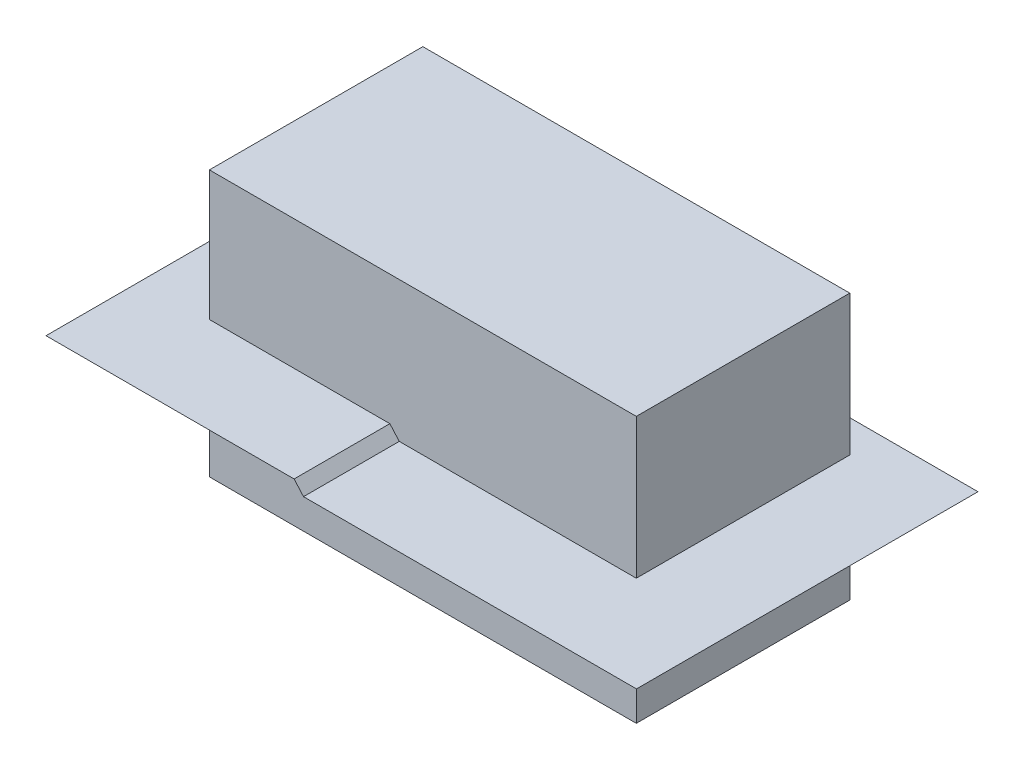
ISO-10303-21;
HEADER;
FILE_DESCRIPTION(('STEP AP214'),'2;1');
FILE_NAME('part.step','',(''),(''),'','','');
FILE_SCHEMA(('AUTOMOTIVE_DESIGN { 1 0 10303 214 1 1 1 1 }'));
ENDSEC;
DATA;
#1=APPLICATION_CONTEXT('core data for automotive mechanical design processes');
#2=APPLICATION_PROTOCOL_DEFINITION('international standard','automotive_design',2000,#1);
#3=PRODUCT_CONTEXT('',#1,'mechanical');
#4=PRODUCT('Part','Part','',(#3));
#5=PRODUCT_RELATED_PRODUCT_CATEGORY('part','',(#4));
#6=PRODUCT_DEFINITION_FORMATION('','',#4);
#7=PRODUCT_DEFINITION_CONTEXT('part definition',#1,'design');
#8=PRODUCT_DEFINITION('design','',#6,#7);
#9=PRODUCT_DEFINITION_SHAPE('','',#8);
#10=(LENGTH_UNIT() NAMED_UNIT(*) SI_UNIT(.MILLI.,.METRE.));
#11=(NAMED_UNIT(*) PLANE_ANGLE_UNIT() SI_UNIT($,.RADIAN.));
#12=(NAMED_UNIT(*) SI_UNIT($,.STERADIAN.) SOLID_ANGLE_UNIT());
#13=UNCERTAINTY_MEASURE_WITH_UNIT(LENGTH_MEASURE(1.E-05),#10,'distance_accuracy_value','');
#14=(GEOMETRIC_REPRESENTATION_CONTEXT(3) GLOBAL_UNCERTAINTY_ASSIGNED_CONTEXT((#13)) GLOBAL_UNIT_ASSIGNED_CONTEXT((#10,
#11,#12)) REPRESENTATION_CONTEXT('',''));
#15=CARTESIAN_POINT('',(0.,0.,0.));
#16=DIRECTION('',(0.,0.,1.));
#17=DIRECTION('',(1.,0.,0.));
#18=AXIS2_PLACEMENT_3D('',#15,#16,#17);
#19=CARTESIAN_POINT('',(-40.7086650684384,3.7238100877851,18.5695273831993));
#20=DIRECTION('',(0.,1.,0.));
#21=DIRECTION('',(0.,0.,1.));
#22=AXIS2_PLACEMENT_3D('',#19,#20,#21);
#23=PLANE('',#22);
#24=DIRECTION('',(-1.,0.,0.));
#25=VECTOR('',#24,1.);
#26=CARTESIAN_POINT('',(-34.9005323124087,3.7238100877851,8.94289846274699));
#27=LINE('',#26,#25);
#28=CARTESIAN_POINT('',(-24.1925625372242,3.7238100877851,8.94289846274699));
#29=VERTEX_POINT('',#28);
#30=CARTESIAN_POINT('',(-34.9005323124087,3.7238100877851,8.94289846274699));
#31=VERTEX_POINT('',#30);
#32=EDGE_CURVE('E351',#29,#31,#27,.T.);
#33=ORIENTED_EDGE('',*,*,#32,.F.);
#34=DIRECTION('',(0.,0.,1.));
#35=VECTOR('',#34,1.);
#36=CARTESIAN_POINT('',(-24.1925625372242,3.7238100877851,-8.94289846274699));
#37=LINE('',#36,#35);
#38=CARTESIAN_POINT('',(-24.1925625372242,3.7238100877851,-8.94289846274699));
#39=VERTEX_POINT('',#38);
#40=EDGE_CURVE('E320',#39,#29,#37,.T.);
#41=ORIENTED_EDGE('',*,*,#40,.F.);
#42=DIRECTION('',(1.,0.,0.));
#43=VECTOR('',#42,1.);
#44=CARTESIAN_POINT('',(-34.9005323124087,3.7238100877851,-8.94289846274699));
#45=LINE('',#44,#43);
#46=CARTESIAN_POINT('',(-34.9005323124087,3.7238100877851,-8.94289846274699));
#47=VERTEX_POINT('',#46);
#48=EDGE_CURVE('E408',#47,#39,#45,.T.);
#49=ORIENTED_EDGE('',*,*,#48,.F.);
#50=DIRECTION('',(0.,0.,-1.));
#51=VECTOR('',#50,1.);
#52=CARTESIAN_POINT('',(-34.9005323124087,3.7238100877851,-8.94289846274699));
#53=LINE('',#52,#51);
#54=EDGE_CURVE('E61',#31,#47,#53,.T.);
#55=ORIENTED_EDGE('',*,*,#54,.F.);
#56=EDGE_LOOP('',(#33,#41,#49,#55));
#57=FACE_BOUND('',#56,.T.);
#58=ADVANCED_FACE('F44',(#57),#23,.T.);
#59=CARTESIAN_POINT('',(75.7086650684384,-2.5,18.5695273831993));
#60=DIRECTION('',(0.,1.,0.));
#61=DIRECTION('',(0.,0.,1.));
#62=AXIS2_PLACEMENT_3D('',#59,#60,#61);
#63=PLANE('',#62);
#64=DIRECTION('',(0.,0.,1.));
#65=VECTOR('',#64,1.);
#66=CARTESIAN_POINT('',(-13.811539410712,-2.5,18.5695273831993));
#67=LINE('',#66,#65);
#68=CARTESIAN_POINT('',(-13.811539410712,-2.5,18.5695273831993));
#69=VERTEX_POINT('',#68);
#70=CARTESIAN_POINT('',(-13.811539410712,-2.5,62.5));
#71=VERTEX_POINT('',#70);
#72=EDGE_CURVE('E612',#69,#71,#67,.T.);
#73=ORIENTED_EDGE('',*,*,#72,.T.);
#74=DIRECTION('',(1.,0.,0.));
#75=VECTOR('',#74,1.);
#76=CARTESIAN_POINT('',(-125.,-2.5,62.5));
#77=LINE('',#76,#75);
#78=CARTESIAN_POINT('',(125.,-2.5,62.5));
#79=VERTEX_POINT('',#78);
#80=EDGE_CURVE('E469',#71,#79,#77,.T.);
#81=ORIENTED_EDGE('',*,*,#80,.T.);
#82=DIRECTION('',(0.,0.,-1.));
#83=VECTOR('',#82,1.);
#84=CARTESIAN_POINT('',(125.,-2.5,62.5));
#85=LINE('',#84,#83);
#86=CARTESIAN_POINT('',(125.,-2.5,-62.5));
#87=VERTEX_POINT('',#86);
#88=EDGE_CURVE('E477',#79,#87,#85,.T.);
#89=ORIENTED_EDGE('',*,*,#88,.T.);
#90=DIRECTION('',(-1.,0.,0.));
#91=VECTOR('',#90,1.);
#92=CARTESIAN_POINT('',(-125.,-2.5,-62.5));
#93=LINE('',#92,#91);
#94=CARTESIAN_POINT('',(-13.811539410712,-2.5,-62.5));
#95=VERTEX_POINT('',#94);
#96=EDGE_CURVE('E480',#87,#95,#93,.T.);
#97=ORIENTED_EDGE('',*,*,#96,.T.);
#98=CARTESIAN_POINT('',(-13.811539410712,-2.5,-18.5695273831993));
#99=VERTEX_POINT('',#98);
#100=EDGE_CURVE('E319',#95,#99,#67,.T.);
#101=ORIENTED_EDGE('',*,*,#100,.T.);
#102=DIRECTION('',(-1.,0.,0.));
#103=VECTOR('',#102,1.);
#104=CARTESIAN_POINT('',(-40.7086650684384,-2.5,-18.5695273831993));
#105=LINE('',#104,#103);
#106=CARTESIAN_POINT('',(-11.3977082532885,-2.5,-18.5695273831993));
#107=VERTEX_POINT('',#106);
#108=EDGE_CURVE('E459',#107,#99,#105,.T.);
#109=ORIENTED_EDGE('',*,*,#108,.F.);
#110=DIRECTION('',(0.,0.,-1.));
#111=VECTOR('',#110,1.);
#112=CARTESIAN_POINT('',(-11.3977082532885,-2.5,-13.058004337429));
#113=LINE('',#112,#111);
#114=CARTESIAN_POINT('',(-11.3977082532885,-2.5,-13.058004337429));
#115=VERTEX_POINT('',#114);
#116=EDGE_CURVE('E432',#115,#107,#113,.T.);
#117=ORIENTED_EDGE('',*,*,#116,.F.);
#118=DIRECTION('',(-1.,0.,0.));
#119=VECTOR('',#118,1.);
#120=CARTESIAN_POINT('',(25.2903479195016,-2.5,-13.0580043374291));
#121=LINE('',#120,#119);
#122=CARTESIAN_POINT('',(25.2903479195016,-2.5,-13.0580043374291));
#123=VERTEX_POINT('',#122);
#124=EDGE_CURVE('E434',#123,#115,#121,.T.);
#125=ORIENTED_EDGE('',*,*,#124,.F.);
#126=DIRECTION('',(0.,0.,1.));
#127=VECTOR('',#126,1.);
#128=CARTESIAN_POINT('',(25.2903479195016,-2.5,-18.5695273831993));
#129=LINE('',#128,#127);
#130=CARTESIAN_POINT('',(25.2903479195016,-2.5,-18.5695273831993));
#131=VERTEX_POINT('',#130);
#132=EDGE_CURVE('E437',#131,#123,#129,.T.);
#133=ORIENTED_EDGE('',*,*,#132,.F.);
#134=DIRECTION('',(-1.,0.,0.));
#135=VECTOR('',#134,1.);
#136=CARTESIAN_POINT('',(-40.7086650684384,-2.5,-18.5695273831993));
#137=LINE('',#136,#135);
#138=CARTESIAN_POINT('',(40.7086650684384,-2.5,-18.5695273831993));
#139=VERTEX_POINT('',#138);
#140=EDGE_CURVE('E450',#139,#131,#137,.T.);
#141=ORIENTED_EDGE('',*,*,#140,.F.);
#142=DIRECTION('',(0.,0.,-1.));
#143=VECTOR('',#142,1.);
#144=CARTESIAN_POINT('',(40.7086650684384,-2.5,-18.5695273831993));
#145=LINE('',#144,#143);
#146=CARTESIAN_POINT('',(40.7086650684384,-2.5,-4.99999999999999));
#147=VERTEX_POINT('',#146);
#148=EDGE_CURVE('E453',#147,#139,#145,.T.);
#149=ORIENTED_EDGE('',*,*,#148,.F.);
#150=DIRECTION('',(-1.,0.,0.));
#151=VECTOR('',#150,1.);
#152=CARTESIAN_POINT('',(75.7086650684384,-2.5,-4.99999999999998));
#153=LINE('',#152,#151);
#154=CARTESIAN_POINT('',(73.7086650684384,-2.5,-4.99999999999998));
#155=VERTEX_POINT('',#154);
#156=EDGE_CURVE('E430',#155,#147,#153,.T.);
#157=ORIENTED_EDGE('',*,*,#156,.F.);
#158=CARTESIAN_POINT('',(73.7086650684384,-2.5,-2.99999999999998));
#159=DIRECTION('',(0.,1.,0.));
#160=DIRECTION('',(0.,0.,1.));
#161=AXIS2_PLACEMENT_3D('',#158,#159,#160);
#162=CIRCLE('',#161,2.);
#163=CARTESIAN_POINT('',(75.7086650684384,-2.5,-2.99999999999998));
#164=VERTEX_POINT('',#163);
#165=EDGE_CURVE('E325',#155,#164,#162,.F.);
#166=ORIENTED_EDGE('',*,*,#165,.T.);
#167=DIRECTION('',(0.,0.,1.));
#168=VECTOR('',#167,1.);
#169=CARTESIAN_POINT('',(75.7086650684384,-2.5,0.));
#170=LINE('',#169,#168);
#171=CARTESIAN_POINT('',(75.7086650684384,-2.5,-1.99999999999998));
#172=VERTEX_POINT('',#171);
#173=EDGE_CURVE('E488',#164,#172,#170,.T.);
#174=ORIENTED_EDGE('',*,*,#173,.T.);
#175=DIRECTION('',(1.,0.,0.));
#176=VECTOR('',#175,1.);
#177=CARTESIAN_POINT('',(-40.7096650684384,-2.5,-2.));
#178=LINE('',#177,#176);
#179=CARTESIAN_POINT('',(37.7086650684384,-2.5,-1.99999999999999));
#180=VERTEX_POINT('',#179);
#181=EDGE_CURVE('E341',#180,#172,#178,.T.);
#182=ORIENTED_EDGE('',*,*,#181,.F.);
#183=DIRECTION('',(0.,0.,1.));
#184=VECTOR('',#183,1.);
#185=CARTESIAN_POINT('',(37.7086650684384,-2.5,5.00000000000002));
#186=LINE('',#185,#184);
#187=CARTESIAN_POINT('',(37.7086650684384,-2.5,-4.99999999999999));
#188=VERTEX_POINT('',#187);
#189=EDGE_CURVE('E424',#188,#180,#186,.T.);
#190=ORIENTED_EDGE('',*,*,#189,.F.);
#191=DIRECTION('',(1.,0.,0.));
#192=VECTOR('',#191,1.);
#193=CARTESIAN_POINT('',(37.7086650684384,-2.5,-4.99999999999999));
#194=LINE('',#193,#192);
#195=CARTESIAN_POINT('',(28.7663146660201,-2.5,-4.99999999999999));
#196=VERTEX_POINT('',#195);
#197=EDGE_CURVE('E421',#196,#188,#194,.T.);
#198=ORIENTED_EDGE('',*,*,#197,.F.);
#199=DIRECTION('',(0.,0.,-1.));
#200=VECTOR('',#199,1.);
#201=CARTESIAN_POINT('',(28.7663146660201,-2.5,5.00000000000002));
#202=LINE('',#201,#200);
#203=CARTESIAN_POINT('',(28.7663146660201,-2.5,5.00000000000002));
#204=VERTEX_POINT('',#203);
#205=EDGE_CURVE('E419',#204,#196,#202,.T.);
#206=ORIENTED_EDGE('',*,*,#205,.F.);
#207=DIRECTION('',(-1.,0.,0.));
#208=VECTOR('',#207,1.);
#209=CARTESIAN_POINT('',(37.7086650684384,-2.5,5.00000000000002));
#210=LINE('',#209,#208);
#211=CARTESIAN_POINT('',(37.7086650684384,-2.5,5.00000000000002));
#212=VERTEX_POINT('',#211);
#213=EDGE_CURVE('E417',#212,#204,#210,.T.);
#214=ORIENTED_EDGE('',*,*,#213,.F.);
#215=CARTESIAN_POINT('',(37.7086650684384,-2.5,2.00000000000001));
#216=VERTEX_POINT('',#215);
#217=EDGE_CURVE('E423',#216,#212,#186,.T.);
#218=ORIENTED_EDGE('',*,*,#217,.F.);
#219=DIRECTION('',(1.,0.,0.));
#220=VECTOR('',#219,1.);
#221=CARTESIAN_POINT('',(-40.7096650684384,-2.5,2.));
#222=LINE('',#221,#220);
#223=CARTESIAN_POINT('',(75.7086650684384,-2.5,2.00000000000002));
#224=VERTEX_POINT('',#223);
#225=EDGE_CURVE('E415',#224,#216,#222,.F.);
#226=ORIENTED_EDGE('',*,*,#225,.F.);
#227=CARTESIAN_POINT('',(75.7086650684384,-2.5,3.00000000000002));
#228=VERTEX_POINT('',#227);
#229=EDGE_CURVE('E334',#224,#228,#170,.T.);
#230=ORIENTED_EDGE('',*,*,#229,.T.);
#231=CARTESIAN_POINT('',(73.7086650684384,-2.5,3.00000000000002));
#232=DIRECTION('',(0.,1.,0.));
#233=DIRECTION('',(0.,0.,1.));
#234=AXIS2_PLACEMENT_3D('',#231,#232,#233);
#235=CIRCLE('',#234,2.);
#236=CARTESIAN_POINT('',(73.7086650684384,-2.5,5.00000000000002));
#237=VERTEX_POINT('',#236);
#238=EDGE_CURVE('E327',#228,#237,#235,.F.);
#239=ORIENTED_EDGE('',*,*,#238,.T.);
#240=DIRECTION('',(-1.,0.,0.));
#241=VECTOR('',#240,1.);
#242=CARTESIAN_POINT('',(75.7086650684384,-2.5,5.00000000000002));
#243=LINE('',#242,#241);
#244=CARTESIAN_POINT('',(40.7086650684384,-2.5,5.00000000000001));
#245=VERTEX_POINT('',#244);
#246=EDGE_CURVE('E427',#245,#237,#243,.F.);
#247=ORIENTED_EDGE('',*,*,#246,.F.);
#248=CARTESIAN_POINT('',(40.7086650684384,-2.5,18.5695273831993));
#249=VERTEX_POINT('',#248);
#250=EDGE_CURVE('E454',#249,#245,#145,.T.);
#251=ORIENTED_EDGE('',*,*,#250,.F.);
#252=DIRECTION('',(1.,0.,0.));
#253=VECTOR('',#252,1.);
#254=CARTESIAN_POINT('',(-40.7086650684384,-2.5,18.5695273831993));
#255=LINE('',#254,#253);
#256=CARTESIAN_POINT('',(25.2903479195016,-2.5,18.5695273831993));
#257=VERTEX_POINT('',#256);
#258=EDGE_CURVE('E448',#257,#249,#255,.T.);
#259=ORIENTED_EDGE('',*,*,#258,.F.);
#260=DIRECTION('',(0.,0.,1.));
#261=VECTOR('',#260,1.);
#262=CARTESIAN_POINT('',(25.2903479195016,-2.5,18.5695273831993));
#263=LINE('',#262,#261);
#264=CARTESIAN_POINT('',(25.2903479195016,-2.5,13.058004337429));
#265=VERTEX_POINT('',#264);
#266=EDGE_CURVE('E440',#265,#257,#263,.T.);
#267=ORIENTED_EDGE('',*,*,#266,.F.);
#268=DIRECTION('',(1.,0.,0.));
#269=VECTOR('',#268,1.);
#270=CARTESIAN_POINT('',(25.2903479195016,-2.5,13.058004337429));
#271=LINE('',#270,#269);
#272=CARTESIAN_POINT('',(-11.3977082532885,-2.5,13.058004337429));
#273=VERTEX_POINT('',#272);
#274=EDGE_CURVE('E442',#273,#265,#271,.T.);
#275=ORIENTED_EDGE('',*,*,#274,.F.);
#276=DIRECTION('',(0.,0.,-1.));
#277=VECTOR('',#276,1.);
#278=CARTESIAN_POINT('',(-11.3977082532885,-2.5,13.058004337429));
#279=LINE('',#278,#277);
#280=CARTESIAN_POINT('',(-11.3977082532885,-2.5,18.5695273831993));
#281=VERTEX_POINT('',#280);
#282=EDGE_CURVE('E445',#281,#273,#279,.T.);
#283=ORIENTED_EDGE('',*,*,#282,.F.);
#284=DIRECTION('',(1.,0.,0.));
#285=VECTOR('',#284,1.);
#286=CARTESIAN_POINT('',(-40.7086650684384,-2.5,18.5695273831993));
#287=LINE('',#286,#285);
#288=EDGE_CURVE('E464',#69,#281,#287,.T.);
#289=ORIENTED_EDGE('',*,*,#288,.F.);
#290=EDGE_LOOP('',(#73,#81,#89,#97,#101,#109,#117,#125,#133,#141,#149,#157,#166,#174,#182,#190,
#198,#206,#214,#218,#226,#230,#239,#247,#251,#259,#267,#275,#283,#289));
#291=FACE_BOUND('',#290,.T.);
#292=ADVANCED_FACE('F491',(#291),#63,.T.);
#293=DIRECTION('',(0.,0.,1.));
#294=VECTOR('',#293,1.);
#295=CARTESIAN_POINT('',(-125.,3.72381008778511,62.5));
#296=LINE('',#295,#294);
#297=CARTESIAN_POINT('',(-125.,3.72381008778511,-62.5));
#298=VERTEX_POINT('',#297);
#299=CARTESIAN_POINT('',(-125.,3.72381008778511,62.5));
#300=VERTEX_POINT('',#299);
#301=EDGE_CURVE('E467',#298,#300,#296,.T.);
#302=ORIENTED_EDGE('',*,*,#301,.T.);
#303=DIRECTION('',(1.,0.,0.));
#304=VECTOR('',#303,1.);
#305=CARTESIAN_POINT('',(-125.,3.72381008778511,62.5));
#306=LINE('',#305,#304);
#307=CARTESIAN_POINT('',(-19.329556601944,3.72381008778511,62.5));
#308=VERTEX_POINT('',#307);
#309=EDGE_CURVE('E475',#300,#308,#306,.T.);
#310=ORIENTED_EDGE('',*,*,#309,.T.);
#311=DIRECTION('',(0.,0.,1.));
#312=VECTOR('',#311,1.);
#313=CARTESIAN_POINT('',(-19.3295566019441,3.7238100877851,18.5695273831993));
#314=LINE('',#313,#312);
#315=CARTESIAN_POINT('',(-19.3295566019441,3.7238100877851,18.5695273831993));
#316=VERTEX_POINT('',#315);
#317=EDGE_CURVE('E12',#316,#308,#314,.T.);
#318=ORIENTED_EDGE('',*,*,#317,.F.);
#319=DIRECTION('',(1.,0.,0.));
#320=VECTOR('',#319,1.);
#321=CARTESIAN_POINT('',(-40.7086650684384,3.7238100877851,18.5695273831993));
#322=LINE('',#321,#320);
#323=CARTESIAN_POINT('',(-40.7086650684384,3.7238100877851,18.5695273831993));
#324=VERTEX_POINT('',#323);
#325=EDGE_CURVE('E301',#324,#316,#322,.T.);
#326=ORIENTED_EDGE('',*,*,#325,.F.);
#327=DIRECTION('',(0.,0.,-1.));
#328=VECTOR('',#327,1.);
#329=CARTESIAN_POINT('',(-40.7086650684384,3.7238100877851,18.5695273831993));
#330=LINE('',#329,#328);
#331=CARTESIAN_POINT('',(-40.7086650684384,3.7238100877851,-18.5695273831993));
#332=VERTEX_POINT('',#331);
#333=EDGE_CURVE('E48',#324,#332,#330,.T.);
#334=ORIENTED_EDGE('',*,*,#333,.T.);
#335=DIRECTION('',(-1.,0.,0.));
#336=VECTOR('',#335,1.);
#337=CARTESIAN_POINT('',(-40.7086650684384,3.7238100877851,-18.5695273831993));
#338=LINE('',#337,#336);
#339=CARTESIAN_POINT('',(-19.3295566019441,3.7238100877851,-18.5695273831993));
#340=VERTEX_POINT('',#339);
#341=EDGE_CURVE('E400',#340,#332,#338,.T.);
#342=ORIENTED_EDGE('',*,*,#341,.F.);
#343=CARTESIAN_POINT('',(-19.329556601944,3.72381008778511,-62.5));
#344=VERTEX_POINT('',#343);
#345=EDGE_CURVE('E53',#344,#340,#314,.T.);
#346=ORIENTED_EDGE('',*,*,#345,.F.);
#347=DIRECTION('',(-1.,0.,0.));
#348=VECTOR('',#347,1.);
#349=CARTESIAN_POINT('',(-125.,3.72381008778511,-62.5));
#350=LINE('',#349,#348);
#351=EDGE_CURVE('E486',#344,#298,#350,.T.);
#352=ORIENTED_EDGE('',*,*,#351,.T.);
#353=EDGE_LOOP('',(#302,#310,#318,#326,#334,#342,#346,#352));
#354=FACE_BOUND('',#353,.T.);
#355=ADVANCED_FACE('F316',(#354),#23,.T.);
#356=CARTESIAN_POINT('',(-13.811539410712,-2.5,18.5695273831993));
#357=DIRECTION('',(0.748259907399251,0.663405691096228,0.));
#358=DIRECTION('',(-0.663405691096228,0.748259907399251,0.));
#359=AXIS2_PLACEMENT_3D('',#356,#357,#358);
#360=PLANE('',#359);
#361=ORIENTED_EDGE('',*,*,#317,.T.);
#362=DIRECTION('',(0.663405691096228,-0.748259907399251,0.));
#363=VECTOR('',#362,1.);
#364=CARTESIAN_POINT('',(-103.500801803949,98.6611447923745,62.5));
#365=LINE('',#364,#363);
#366=EDGE_CURVE('E472',#308,#71,#365,.T.);
#367=ORIENTED_EDGE('',*,*,#366,.T.);
#368=ORIENTED_EDGE('',*,*,#72,.F.);
#369=DIRECTION('',(0.663405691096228,-0.748259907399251,0.));
#370=VECTOR('',#369,1.);
#371=CARTESIAN_POINT('',(-29.372154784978,15.0509266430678,18.5695273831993));
#372=LINE('',#371,#370);
#373=EDGE_CURVE('E462',#316,#69,#372,.T.);
#374=ORIENTED_EDGE('',*,*,#373,.F.);
#375=EDGE_LOOP('',(#361,#367,#368,#374));
#376=FACE_BOUND('',#375,.T.);
#377=ADVANCED_FACE('F638',(#376),#360,.T.);
#378=ORIENTED_EDGE('',*,*,#100,.F.);
#379=DIRECTION('',(-0.663405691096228,0.748259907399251,0.));
#380=VECTOR('',#379,1.);
#381=CARTESIAN_POINT('',(-103.500801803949,98.6611447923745,-62.5));
#382=LINE('',#381,#380);
#383=EDGE_CURVE('E483',#95,#344,#382,.T.);
#384=ORIENTED_EDGE('',*,*,#383,.T.);
#385=ORIENTED_EDGE('',*,*,#345,.T.);
#386=DIRECTION('',(-0.663405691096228,0.748259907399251,0.));
#387=VECTOR('',#386,1.);
#388=CARTESIAN_POINT('',(-29.372154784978,15.0509266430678,-18.5695273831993));
#389=LINE('',#388,#387);
#390=EDGE_CURVE('E457',#99,#340,#389,.T.);
#391=ORIENTED_EDGE('',*,*,#390,.F.);
#392=EDGE_LOOP('',(#378,#384,#385,#391));
#393=FACE_BOUND('',#392,.T.);
#394=ADVANCED_FACE('F633',(#393),#360,.T.);
#395=CARTESIAN_POINT('',(-40.7086650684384,5.,-18.5695273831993));
#396=DIRECTION('',(0.,0.,1.));
#397=DIRECTION('',(1.,0.,0.));
#398=AXIS2_PLACEMENT_3D('',#395,#396,#397);
#399=PLANE('',#398);
#400=DIRECTION('',(0.,-1.,0.));
#401=VECTOR('',#400,1.);
#402=CARTESIAN_POINT('',(40.7086650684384,5.,-18.5695273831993));
#403=LINE('',#402,#401);
#404=CARTESIAN_POINT('',(40.7086650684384,-10.,-18.5695273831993));
#405=VERTEX_POINT('',#404);
#406=EDGE_CURVE('E356',#139,#405,#403,.T.);
#407=ORIENTED_EDGE('',*,*,#406,.F.);
#408=ORIENTED_EDGE('',*,*,#140,.T.);
#409=DIRECTION('',(0.,1.,0.));
#410=VECTOR('',#409,1.);
#411=CARTESIAN_POINT('',(25.2903479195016,-10.001,-18.5695273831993));
#412=LINE('',#411,#410);
#413=CARTESIAN_POINT('',(25.2903479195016,-10.,-18.5695273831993));
#414=VERTEX_POINT('',#413);
#415=EDGE_CURVE('E372',#414,#131,#412,.T.);
#416=ORIENTED_EDGE('',*,*,#415,.F.);
#417=DIRECTION('',(-1.,0.,0.));
#418=VECTOR('',#417,1.);
#419=CARTESIAN_POINT('',(-40.7086650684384,-10.,-18.5695273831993));
#420=LINE('',#419,#418);
#421=EDGE_CURVE('E513',#405,#414,#420,.T.);
#422=ORIENTED_EDGE('',*,*,#421,.F.);
#423=EDGE_LOOP('',(#407,#408,#416,#422));
#424=FACE_BOUND('',#423,.T.);
#425=ADVANCED_FACE('F511',(#424),#399,.T.);
#426=CARTESIAN_POINT('',(40.7086650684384,5.,-18.5695273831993));
#427=DIRECTION('',(-1.,0.,0.));
#428=DIRECTION('',(0.,0.,1.));
#429=AXIS2_PLACEMENT_3D('',#426,#427,#428);
#430=PLANE('',#429);
#431=DIRECTION('',(0.,-1.,0.));
#432=VECTOR('',#431,1.);
#433=CARTESIAN_POINT('',(40.7086650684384,5.,18.5695273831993));
#434=LINE('',#433,#432);
#435=CARTESIAN_POINT('',(40.7086650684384,-10.,18.5695273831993));
#436=VERTEX_POINT('',#435);
#437=EDGE_CURVE('E310',#249,#436,#434,.T.);
#438=ORIENTED_EDGE('',*,*,#437,.F.);
#439=ORIENTED_EDGE('',*,*,#250,.T.);
#440=CARTESIAN_POINT('',(40.7086650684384,-2.5,0.));
#441=DIRECTION('',(-1.,0.,0.));
#442=DIRECTION('',(0.,0.,1.));
#443=AXIS2_PLACEMENT_3D('',#440,#441,#442);
#444=CIRCLE('',#443,5.);
#445=EDGE_CURVE('E311',#245,#147,#444,.F.);
#446=ORIENTED_EDGE('',*,*,#445,.T.);
#447=ORIENTED_EDGE('',*,*,#148,.T.);
#448=ORIENTED_EDGE('',*,*,#406,.T.);
#449=DIRECTION('',(0.,0.,-1.));
#450=VECTOR('',#449,1.);
#451=CARTESIAN_POINT('',(40.7086650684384,-10.,-18.5695273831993));
#452=LINE('',#451,#450);
#453=EDGE_CURVE('E519',#436,#405,#452,.T.);
#454=ORIENTED_EDGE('',*,*,#453,.F.);
#455=EDGE_LOOP('',(#438,#439,#446,#447,#448,#454));
#456=FACE_BOUND('',#455,.T.);
#457=ADVANCED_FACE('F502',(#456),#430,.T.);
#458=CARTESIAN_POINT('',(37.7086650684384,0.,-4.99999999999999));
#459=DIRECTION('',(0.,0.,-1.));
#460=DIRECTION('',(-1.,0.,0.));
#461=AXIS2_PLACEMENT_3D('',#458,#459,#460);
#462=PLANE('',#461);
#463=DIRECTION('',(0.,-1.,0.));
#464=VECTOR('',#463,1.);
#465=CARTESIAN_POINT('',(28.7663146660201,0.,-4.99999999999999));
#466=LINE('',#465,#464);
#467=CARTESIAN_POINT('',(28.7663146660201,-10.,-4.99999999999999));
#468=VERTEX_POINT('',#467);
#469=EDGE_CURVE('E388',#196,#468,#466,.T.);
#470=ORIENTED_EDGE('',*,*,#469,.F.);
#471=ORIENTED_EDGE('',*,*,#197,.T.);
#472=DIRECTION('',(0.,-1.,0.));
#473=VECTOR('',#472,1.);
#474=CARTESIAN_POINT('',(37.7086650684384,0.,-4.99999999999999));
#475=LINE('',#474,#473);
#476=CARTESIAN_POINT('',(37.7086650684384,-10.,-4.99999999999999));
#477=VERTEX_POINT('',#476);
#478=EDGE_CURVE('E386',#188,#477,#475,.T.);
#479=ORIENTED_EDGE('',*,*,#478,.T.);
#480=DIRECTION('',(1.,0.,0.));
#481=VECTOR('',#480,1.);
#482=CARTESIAN_POINT('',(37.7086650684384,-10.,-4.99999999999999));
#483=LINE('',#482,#481);
#484=EDGE_CURVE('E394',#468,#477,#483,.T.);
#485=ORIENTED_EDGE('',*,*,#484,.F.);
#486=EDGE_LOOP('',(#470,#471,#479,#485));
#487=FACE_BOUND('',#486,.T.);
#488=ADVANCED_FACE('F651',(#487),#462,.T.);
#489=CARTESIAN_POINT('',(-40.7086650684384,-10.,18.5695273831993));
#490=DIRECTION('',(0.,1.,0.));
#491=DIRECTION('',(0.,0.,1.));
#492=AXIS2_PLACEMENT_3D('',#489,#490,#491);
#493=PLANE('',#492);
#494=DIRECTION('',(-1.,0.,0.));
#495=VECTOR('',#494,1.);
#496=CARTESIAN_POINT('',(37.7086650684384,-10.,5.00000000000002));
#497=LINE('',#496,#495);
#498=CARTESIAN_POINT('',(37.7086650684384,-10.,5.00000000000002));
#499=VERTEX_POINT('',#498);
#500=CARTESIAN_POINT('',(28.7663146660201,-10.,5.00000000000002));
#501=VERTEX_POINT('',#500);
#502=EDGE_CURVE('E608',#499,#501,#497,.T.);
#503=ORIENTED_EDGE('',*,*,#502,.T.);
#504=DIRECTION('',(0.,0.,-1.));
#505=VECTOR('',#504,1.);
#506=CARTESIAN_POINT('',(28.7663146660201,-10.,5.00000000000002));
#507=LINE('',#506,#505);
#508=EDGE_CURVE('E605',#501,#468,#507,.T.);
#509=ORIENTED_EDGE('',*,*,#508,.T.);
#510=ORIENTED_EDGE('',*,*,#484,.T.);
#511=DIRECTION('',(0.,0.,1.));
#512=VECTOR('',#511,1.);
#513=CARTESIAN_POINT('',(37.7086650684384,-10.,5.00000000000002));
#514=LINE('',#513,#512);
#515=EDGE_CURVE('E398',#477,#499,#514,.T.);
#516=ORIENTED_EDGE('',*,*,#515,.T.);
#517=EDGE_LOOP('',(#503,#509,#510,#516));
#518=FACE_BOUND('',#517,.T.);
#519=DIRECTION('',(-1.,0.,0.));
#520=VECTOR('',#519,1.);
#521=CARTESIAN_POINT('',(25.2903479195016,-10.,-13.0580043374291));
#522=LINE('',#521,#520);
#523=CARTESIAN_POINT('',(25.2903479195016,-10.,-13.0580043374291));
#524=VERTEX_POINT('',#523);
#525=CARTESIAN_POINT('',(6.01296419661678,-10.,-13.058004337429));
#526=VERTEX_POINT('',#525);
#527=EDGE_CURVE('E591',#524,#526,#522,.T.);
#528=ORIENTED_EDGE('',*,*,#527,.T.);
#529=DIRECTION('',(0.,0.,1.));
#530=VECTOR('',#529,1.);
#531=CARTESIAN_POINT('',(6.01296419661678,-10.,-18.5695273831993));
#532=LINE('',#531,#530);
#533=CARTESIAN_POINT('',(6.01296419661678,-10.,13.058004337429));
#534=VERTEX_POINT('',#533);
#535=EDGE_CURVE('E543',#526,#534,#532,.T.);
#536=ORIENTED_EDGE('',*,*,#535,.T.);
#537=DIRECTION('',(1.,0.,0.));
#538=VECTOR('',#537,1.);
#539=CARTESIAN_POINT('',(25.2903479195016,-10.,13.058004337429));
#540=LINE('',#539,#538);
#541=CARTESIAN_POINT('',(25.2903479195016,-10.,13.058004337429));
#542=VERTEX_POINT('',#541);
#543=EDGE_CURVE('E588',#534,#542,#540,.T.);
#544=ORIENTED_EDGE('',*,*,#543,.T.);
#545=DIRECTION('',(0.,0.,1.));
#546=VECTOR('',#545,1.);
#547=CARTESIAN_POINT('',(25.2903479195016,-10.,18.5695273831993));
#548=LINE('',#547,#546);
#549=CARTESIAN_POINT('',(25.2903479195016,-10.,18.5695273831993));
#550=VERTEX_POINT('',#549);
#551=EDGE_CURVE('E362',#542,#550,#548,.T.);
#552=ORIENTED_EDGE('',*,*,#551,.T.);
#553=DIRECTION('',(1.,0.,0.));
#554=VECTOR('',#553,1.);
#555=CARTESIAN_POINT('',(-40.7086650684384,-10.,18.5695273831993));
#556=LINE('',#555,#554);
#557=EDGE_CURVE('E526',#550,#436,#556,.T.);
#558=ORIENTED_EDGE('',*,*,#557,.T.);
#559=ORIENTED_EDGE('',*,*,#453,.T.);
#560=ORIENTED_EDGE('',*,*,#421,.T.);
#561=DIRECTION('',(0.,0.,1.));
#562=VECTOR('',#561,1.);
#563=CARTESIAN_POINT('',(25.2903479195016,-10.,-18.5695273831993));
#564=LINE('',#563,#562);
#565=EDGE_CURVE('E385',#414,#524,#564,.T.);
#566=ORIENTED_EDGE('',*,*,#565,.T.);
#567=EDGE_LOOP('',(#528,#536,#544,#552,#558,#559,#560,#566));
#568=FACE_BOUND('',#567,.T.);
#569=ADVANCED_FACE('F714',(#518,#568),#493,.T.);
#570=CARTESIAN_POINT('',(28.7663146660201,0.,5.00000000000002));
#571=DIRECTION('',(-1.,0.,0.));
#572=DIRECTION('',(0.,0.,1.));
#573=AXIS2_PLACEMENT_3D('',#570,#571,#572);
#574=PLANE('',#573);
#575=DIRECTION('',(0.,-1.,0.));
#576=VECTOR('',#575,1.);
#577=CARTESIAN_POINT('',(28.7663146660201,0.,5.00000000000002));
#578=LINE('',#577,#576);
#579=EDGE_CURVE('E69',#204,#501,#578,.T.);
#580=ORIENTED_EDGE('',*,*,#579,.F.);
#581=ORIENTED_EDGE('',*,*,#205,.T.);
#582=ORIENTED_EDGE('',*,*,#469,.T.);
#583=ORIENTED_EDGE('',*,*,#508,.F.);
#584=EDGE_LOOP('',(#580,#581,#582,#583));
#585=FACE_BOUND('',#584,.T.);
#586=ADVANCED_FACE('F757',(#585),#574,.T.);
#587=CARTESIAN_POINT('',(37.7086650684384,0.,5.00000000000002));
#588=DIRECTION('',(1.,0.,0.));
#589=DIRECTION('',(0.,0.,-1.));
#590=AXIS2_PLACEMENT_3D('',#587,#588,#589);
#591=PLANE('',#590);
#592=ORIENTED_EDGE('',*,*,#478,.F.);
#593=ORIENTED_EDGE('',*,*,#189,.T.);
#594=CARTESIAN_POINT('',(37.7086650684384,-2.5,0.));
#595=DIRECTION('',(1.,0.,0.));
#596=DIRECTION('',(0.,0.,-1.));
#597=AXIS2_PLACEMENT_3D('',#594,#595,#596);
#598=CIRCLE('',#597,2.);
#599=EDGE_CURVE('E395',#180,#216,#598,.F.);
#600=ORIENTED_EDGE('',*,*,#599,.T.);
#601=ORIENTED_EDGE('',*,*,#217,.T.);
#602=DIRECTION('',(0.,-1.,0.));
#603=VECTOR('',#602,1.);
#604=CARTESIAN_POINT('',(37.7086650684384,0.,5.00000000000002));
#605=LINE('',#604,#603);
#606=EDGE_CURVE('E392',#212,#499,#605,.T.);
#607=ORIENTED_EDGE('',*,*,#606,.T.);
#608=ORIENTED_EDGE('',*,*,#515,.F.);
#609=EDGE_LOOP('',(#592,#593,#600,#601,#607,#608));
#610=FACE_BOUND('',#609,.T.);
#611=ADVANCED_FACE('F752',(#610),#591,.T.);
#612=CARTESIAN_POINT('',(75.7086650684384,-2.5,0.));
#613=DIRECTION('',(-1.,0.,0.));
#614=DIRECTION('',(0.,0.,1.));
#615=AXIS2_PLACEMENT_3D('',#612,#613,#614);
#616=CYLINDRICAL_SURFACE('',#615,5.);
#617=CARTESIAN_POINT('',(73.7086650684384,-2.5,0.));
#618=DIRECTION('',(1.,0.,0.));
#619=DIRECTION('',(0.,0.,-1.));
#620=AXIS2_PLACEMENT_3D('',#617,#618,#619);
#621=CIRCLE('',#620,5.);
#622=EDGE_CURVE('E348',#155,#237,#621,.F.);
#623=ORIENTED_EDGE('',*,*,#622,.F.);
#624=ORIENTED_EDGE('',*,*,#156,.T.);
#625=ORIENTED_EDGE('',*,*,#445,.F.);
#626=ORIENTED_EDGE('',*,*,#246,.T.);
#627=EDGE_LOOP('',(#623,#624,#625,#626));
#628=FACE_BOUND('',#627,.T.);
#629=ADVANCED_FACE('F505',(#628),#616,.F.);
#630=CARTESIAN_POINT('',(75.7086650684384,-2.5,0.));
#631=DIRECTION('',(1.,0.,0.));
#632=DIRECTION('',(0.,0.,-1.));
#633=AXIS2_PLACEMENT_3D('',#630,#631,#632);
#634=PLANE('',#633);
#635=ORIENTED_EDGE('',*,*,#173,.F.);
#636=CARTESIAN_POINT('',(75.7086650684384,-2.5,0.));
#637=DIRECTION('',(1.,0.,0.));
#638=DIRECTION('',(0.,0.,-1.));
#639=AXIS2_PLACEMENT_3D('',#636,#637,#638);
#640=CIRCLE('',#639,3.);
#641=EDGE_CURVE('E350',#228,#164,#640,.T.);
#642=ORIENTED_EDGE('',*,*,#641,.F.);
#643=ORIENTED_EDGE('',*,*,#229,.F.);
#644=CARTESIAN_POINT('',(75.7086650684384,-2.5,0.));
#645=DIRECTION('',(1.,0.,0.));
#646=DIRECTION('',(0.,0.,-1.));
#647=AXIS2_PLACEMENT_3D('',#644,#645,#646);
#648=CIRCLE('',#647,2.);
#649=EDGE_CURVE('E397',#224,#172,#648,.T.);
#650=ORIENTED_EDGE('',*,*,#649,.T.);
#651=EDGE_LOOP('',(#635,#642,#643,#650));
#652=FACE_BOUND('',#651,.T.);
#653=ADVANCED_FACE('F493',(#652),#634,.F.);
#654=CARTESIAN_POINT('',(73.7086650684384,-2.5,0.));
#655=DIRECTION('',(1.,0.,0.));
#656=DIRECTION('',(0.,0.,-1.));
#657=AXIS2_PLACEMENT_3D('',#654,#655,#656);
#658=TOROIDAL_SURFACE('',#657,3.,2.);
#659=ORIENTED_EDGE('',*,*,#238,.F.);
#660=ORIENTED_EDGE('',*,*,#641,.T.);
#661=ORIENTED_EDGE('',*,*,#165,.F.);
#662=ORIENTED_EDGE('',*,*,#622,.T.);
#663=EDGE_LOOP('',(#659,#660,#661,#662));
#664=FACE_BOUND('',#663,.T.);
#665=ADVANCED_FACE('F495',(#664),#658,.F.);
#666=CARTESIAN_POINT('',(-40.7096650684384,-2.5,0.));
#667=DIRECTION('',(1.,0.,0.));
#668=DIRECTION('',(0.,0.,-1.));
#669=AXIS2_PLACEMENT_3D('',#666,#667,#668);
#670=CYLINDRICAL_SURFACE('',#669,2.);
#671=ORIENTED_EDGE('',*,*,#649,.F.);
#672=ORIENTED_EDGE('',*,*,#225,.T.);
#673=ORIENTED_EDGE('',*,*,#599,.F.);
#674=ORIENTED_EDGE('',*,*,#181,.T.);
#675=EDGE_LOOP('',(#671,#672,#673,#674));
#676=FACE_BOUND('',#675,.T.);
#677=ADVANCED_FACE('F767',(#676),#670,.T.);
#678=CARTESIAN_POINT('',(37.7086650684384,0.,5.00000000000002));
#679=DIRECTION('',(0.,0.,1.));
#680=DIRECTION('',(1.,0.,0.));
#681=AXIS2_PLACEMENT_3D('',#678,#679,#680);
#682=PLANE('',#681);
#683=ORIENTED_EDGE('',*,*,#606,.F.);
#684=ORIENTED_EDGE('',*,*,#213,.T.);
#685=ORIENTED_EDGE('',*,*,#579,.T.);
#686=ORIENTED_EDGE('',*,*,#502,.F.);
#687=EDGE_LOOP('',(#683,#684,#685,#686));
#688=FACE_BOUND('',#687,.T.);
#689=ADVANCED_FACE('F721',(#688),#682,.T.);
#690=CARTESIAN_POINT('',(6.01296419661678,-6.1347022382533,-18.5695273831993));
#691=DIRECTION('',(1.,0.,0.));
#692=DIRECTION('',(0.,0.,-1.));
#693=AXIS2_PLACEMENT_3D('',#690,#691,#692);
#694=PLANE('',#693);
#695=DIRECTION('',(0.,0.,1.));
#696=VECTOR('',#695,1.);
#697=CARTESIAN_POINT('',(6.01296419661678,-6.1347022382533,-18.5695273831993));
#698=LINE('',#697,#696);
#699=CARTESIAN_POINT('',(6.01296419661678,-6.1347022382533,-13.058004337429));
#700=VERTEX_POINT('',#699);
#701=CARTESIAN_POINT('',(6.01296419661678,-6.1347022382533,13.058004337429));
#702=VERTEX_POINT('',#701);
#703=EDGE_CURVE('E546',#700,#702,#698,.T.);
#704=ORIENTED_EDGE('',*,*,#703,.T.);
#705=DIRECTION('',(0.,-1.,0.));
#706=VECTOR('',#705,1.);
#707=CARTESIAN_POINT('',(6.01296419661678,-10.001,13.058004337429));
#708=LINE('',#707,#706);
#709=EDGE_CURVE('E582',#702,#534,#708,.T.);
#710=ORIENTED_EDGE('',*,*,#709,.T.);
#711=ORIENTED_EDGE('',*,*,#535,.F.);
#712=DIRECTION('',(0.,1.,0.));
#713=VECTOR('',#712,1.);
#714=CARTESIAN_POINT('',(6.01296419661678,-10.001,-13.058004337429));
#715=LINE('',#714,#713);
#716=EDGE_CURVE('E597',#526,#700,#715,.T.);
#717=ORIENTED_EDGE('',*,*,#716,.T.);
#718=EDGE_LOOP('',(#704,#710,#711,#717));
#719=FACE_BOUND('',#718,.T.);
#720=ADVANCED_FACE('F717',(#719),#694,.T.);
#721=CARTESIAN_POINT('',(-7.62838741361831,-6.1347022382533,-18.5695273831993));
#722=DIRECTION('',(0.,1.,0.));
#723=DIRECTION('',(0.,0.,1.));
#724=AXIS2_PLACEMENT_3D('',#721,#722,#723);
#725=PLANE('',#724);
#726=DIRECTION('',(0.,0.,1.));
#727=VECTOR('',#726,1.);
#728=CARTESIAN_POINT('',(-7.62838741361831,-6.1347022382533,-18.5695273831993));
#729=LINE('',#728,#727);
#730=CARTESIAN_POINT('',(-7.62838741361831,-6.1347022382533,-13.058004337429));
#731=VERTEX_POINT('',#730);
#732=CARTESIAN_POINT('',(-7.62838741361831,-6.1347022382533,13.058004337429));
#733=VERTEX_POINT('',#732);
#734=EDGE_CURVE('E548',#731,#733,#729,.T.);
#735=ORIENTED_EDGE('',*,*,#734,.T.);
#736=DIRECTION('',(1.,0.,0.));
#737=VECTOR('',#736,1.);
#738=CARTESIAN_POINT('',(25.2903479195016,-6.1347022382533,13.058004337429));
#739=LINE('',#738,#737);
#740=EDGE_CURVE('E579',#733,#702,#739,.T.);
#741=ORIENTED_EDGE('',*,*,#740,.T.);
#742=ORIENTED_EDGE('',*,*,#703,.F.);
#743=DIRECTION('',(-1.,0.,0.));
#744=VECTOR('',#743,1.);
#745=CARTESIAN_POINT('',(25.2903479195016,-6.1347022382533,-13.0580043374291));
#746=LINE('',#745,#744);
#747=EDGE_CURVE('E595',#700,#731,#746,.T.);
#748=ORIENTED_EDGE('',*,*,#747,.T.);
#749=EDGE_LOOP('',(#735,#741,#742,#748));
#750=FACE_BOUND('',#749,.T.);
#751=ADVANCED_FACE('F720',(#750),#725,.T.);
#752=CARTESIAN_POINT('',(-7.62838741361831,-10.,-18.5695273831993));
#753=DIRECTION('',(-1.,0.,0.));
#754=DIRECTION('',(0.,0.,1.));
#755=AXIS2_PLACEMENT_3D('',#752,#753,#754);
#756=PLANE('',#755);
#757=DIRECTION('',(0.,0.,1.));
#758=VECTOR('',#757,1.);
#759=CARTESIAN_POINT('',(-7.62838741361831,-10.,-18.5695273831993));
#760=LINE('',#759,#758);
#761=CARTESIAN_POINT('',(-7.62838741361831,-10.,-13.058004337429));
#762=VERTEX_POINT('',#761);
#763=CARTESIAN_POINT('',(-7.62838741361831,-10.,13.058004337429));
#764=VERTEX_POINT('',#763);
#765=EDGE_CURVE('E542',#762,#764,#760,.T.);
#766=ORIENTED_EDGE('',*,*,#765,.T.);
#767=DIRECTION('',(0.,1.,0.));
#768=VECTOR('',#767,1.);
#769=CARTESIAN_POINT('',(-7.62838741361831,-10.001,13.058004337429));
#770=LINE('',#769,#768);
#771=EDGE_CURVE('E576',#764,#733,#770,.T.);
#772=ORIENTED_EDGE('',*,*,#771,.T.);
#773=ORIENTED_EDGE('',*,*,#734,.F.);
#774=DIRECTION('',(0.,-1.,0.));
#775=VECTOR('',#774,1.);
#776=CARTESIAN_POINT('',(-7.62838741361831,-10.001,-13.058004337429));
#777=LINE('',#776,#775);
#778=EDGE_CURVE('E593',#731,#762,#777,.T.);
#779=ORIENTED_EDGE('',*,*,#778,.T.);
#780=EDGE_LOOP('',(#766,#772,#773,#779));
#781=FACE_BOUND('',#780,.T.);
#782=ADVANCED_FACE('F725',(#781),#756,.T.);
#783=CARTESIAN_POINT('',(25.2903479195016,-10.001,-18.5695273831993));
#784=DIRECTION('',(1.,0.,0.));
#785=DIRECTION('',(0.,0.,-1.));
#786=AXIS2_PLACEMENT_3D('',#783,#784,#785);
#787=PLANE('',#786);
#788=ORIENTED_EDGE('',*,*,#415,.T.);
#789=ORIENTED_EDGE('',*,*,#132,.T.);
#790=DIRECTION('',(0.,1.,0.));
#791=VECTOR('',#790,1.);
#792=CARTESIAN_POINT('',(25.2903479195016,-10.001,-13.0580043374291));
#793=LINE('',#792,#791);
#794=EDGE_CURVE('E375',#524,#123,#793,.T.);
#795=ORIENTED_EDGE('',*,*,#794,.F.);
#796=ORIENTED_EDGE('',*,*,#565,.F.);
#797=EDGE_LOOP('',(#788,#789,#795,#796));
#798=FACE_BOUND('',#797,.T.);
#799=ADVANCED_FACE('F729',(#798),#787,.T.);
#800=CARTESIAN_POINT('',(25.2903479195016,-10.001,-13.0580043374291));
#801=DIRECTION('',(0.,0.,1.));
#802=DIRECTION('',(1.,0.,0.));
#803=AXIS2_PLACEMENT_3D('',#800,#801,#802);
#804=PLANE('',#803);
#805=ORIENTED_EDGE('',*,*,#794,.T.);
#806=ORIENTED_EDGE('',*,*,#124,.T.);
#807=DIRECTION('',(0.,1.,0.));
#808=VECTOR('',#807,1.);
#809=CARTESIAN_POINT('',(-11.3977082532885,-10.001,-13.058004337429));
#810=LINE('',#809,#808);
#811=CARTESIAN_POINT('',(-11.3977082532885,-10.,-13.058004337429));
#812=VERTEX_POINT('',#811);
#813=EDGE_CURVE('E379',#812,#115,#810,.T.);
#814=ORIENTED_EDGE('',*,*,#813,.F.);
#815=DIRECTION('',(-1.,0.,0.));
#816=VECTOR('',#815,1.);
#817=CARTESIAN_POINT('',(25.2903479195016,-10.,-13.0580043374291));
#818=LINE('',#817,#816);
#819=EDGE_CURVE('E389',#762,#812,#818,.T.);
#820=ORIENTED_EDGE('',*,*,#819,.F.);
#821=ORIENTED_EDGE('',*,*,#778,.F.);
#822=ORIENTED_EDGE('',*,*,#747,.F.);
#823=ORIENTED_EDGE('',*,*,#716,.F.);
#824=ORIENTED_EDGE('',*,*,#527,.F.);
#825=EDGE_LOOP('',(#805,#806,#814,#820,#821,#822,#823,#824));
#826=FACE_BOUND('',#825,.T.);
#827=ADVANCED_FACE('F737',(#826),#804,.T.);
#828=CARTESIAN_POINT('',(-24.1925625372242,-10.001,-8.94289846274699));
#829=DIRECTION('',(1.,0.,0.));
#830=DIRECTION('',(0.,0.,-1.));
#831=AXIS2_PLACEMENT_3D('',#828,#829,#830);
#832=PLANE('',#831);
#833=ORIENTED_EDGE('',*,*,#40,.T.);
#834=DIRECTION('',(0.,1.,0.));
#835=VECTOR('',#834,1.);
#836=CARTESIAN_POINT('',(-24.1925625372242,-10.001,8.94289846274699));
#837=LINE('',#836,#835);
#838=CARTESIAN_POINT('',(-24.1925625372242,0.,8.94289846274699));
#839=VERTEX_POINT('',#838);
#840=EDGE_CURVE('E558',#839,#29,#837,.T.);
#841=ORIENTED_EDGE('',*,*,#840,.F.);
#842=DIRECTION('',(0.,0.,1.));
#843=VECTOR('',#842,1.);
#844=CARTESIAN_POINT('',(-24.1925625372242,0.,-8.94289846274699));
#845=LINE('',#844,#843);
#846=CARTESIAN_POINT('',(-24.1925625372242,0.,-8.94289846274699));
#847=VERTEX_POINT('',#846);
#848=EDGE_CURVE('E571',#847,#839,#845,.T.);
#849=ORIENTED_EDGE('',*,*,#848,.F.);
#850=DIRECTION('',(0.,1.,0.));
#851=VECTOR('',#850,1.);
#852=CARTESIAN_POINT('',(-24.1925625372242,-10.001,-8.94289846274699));
#853=LINE('',#852,#851);
#854=EDGE_CURVE('E561',#847,#39,#853,.T.);
#855=ORIENTED_EDGE('',*,*,#854,.T.);
#856=EDGE_LOOP('',(#833,#841,#849,#855));
#857=FACE_BOUND('',#856,.T.);
#858=ADVANCED_FACE('F620',(#857),#832,.T.);
#859=CARTESIAN_POINT('',(-34.9005323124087,-10.001,8.94289846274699));
#860=DIRECTION('',(0.,0.,1.));
#861=DIRECTION('',(1.,0.,0.));
#862=AXIS2_PLACEMENT_3D('',#859,#860,#861);
#863=PLANE('',#862);
#864=ORIENTED_EDGE('',*,*,#32,.T.);
#865=DIRECTION('',(0.,1.,0.));
#866=VECTOR('',#865,1.);
#867=CARTESIAN_POINT('',(-34.9005323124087,-10.001,8.94289846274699));
#868=LINE('',#867,#866);
#869=CARTESIAN_POINT('',(-34.9005323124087,0.,8.94289846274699));
#870=VERTEX_POINT('',#869);
#871=EDGE_CURVE('E554',#870,#31,#868,.T.);
#872=ORIENTED_EDGE('',*,*,#871,.F.);
#873=DIRECTION('',(-1.,0.,0.));
#874=VECTOR('',#873,1.);
#875=CARTESIAN_POINT('',(-34.9005323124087,0.,8.94289846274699));
#876=LINE('',#875,#874);
#877=EDGE_CURVE('E545',#839,#870,#876,.T.);
#878=ORIENTED_EDGE('',*,*,#877,.F.);
#879=ORIENTED_EDGE('',*,*,#840,.T.);
#880=EDGE_LOOP('',(#864,#872,#878,#879));
#881=FACE_BOUND('',#880,.T.);
#882=ADVANCED_FACE('F630',(#881),#863,.T.);
#883=CARTESIAN_POINT('',(-11.3977082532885,-10.001,13.058004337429));
#884=DIRECTION('',(-1.,0.,0.));
#885=DIRECTION('',(0.,0.,1.));
#886=AXIS2_PLACEMENT_3D('',#883,#884,#885);
#887=PLANE('',#886);
#888=DIRECTION('',(0.,1.,0.));
#889=VECTOR('',#888,1.);
#890=CARTESIAN_POINT('',(-11.3977082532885,-10.001,18.5695273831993));
#891=LINE('',#890,#889);
#892=CARTESIAN_POINT('',(-11.3977082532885,-10.,18.5695273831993));
#893=VERTEX_POINT('',#892);
#894=EDGE_CURVE('E358',#893,#281,#891,.T.);
#895=ORIENTED_EDGE('',*,*,#894,.T.);
#896=ORIENTED_EDGE('',*,*,#282,.T.);
#897=DIRECTION('',(0.,1.,0.));
#898=VECTOR('',#897,1.);
#899=CARTESIAN_POINT('',(-11.3977082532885,-10.001,13.058004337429));
#900=LINE('',#899,#898);
#901=CARTESIAN_POINT('',(-11.3977082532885,-10.,13.058004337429));
#902=VERTEX_POINT('',#901);
#903=EDGE_CURVE('E361',#902,#273,#900,.T.);
#904=ORIENTED_EDGE('',*,*,#903,.F.);
#905=DIRECTION('',(0.,0.,-1.));
#906=VECTOR('',#905,1.);
#907=CARTESIAN_POINT('',(-11.3977082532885,-10.,13.058004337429));
#908=LINE('',#907,#906);
#909=EDGE_CURVE('E371',#893,#902,#908,.T.);
#910=ORIENTED_EDGE('',*,*,#909,.F.);
#911=EDGE_LOOP('',(#895,#896,#904,#910));
#912=FACE_BOUND('',#911,.T.);
#913=ADVANCED_FACE('F690',(#912),#887,.T.);
#914=CARTESIAN_POINT('',(-40.7086650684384,5.,18.5695273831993));
#915=DIRECTION('',(0.,0.,-1.));
#916=DIRECTION('',(-1.,0.,0.));
#917=AXIS2_PLACEMENT_3D('',#914,#915,#916);
#918=PLANE('',#917);
#919=ORIENTED_EDGE('',*,*,#373,.T.);
#920=ORIENTED_EDGE('',*,*,#288,.T.);
#921=ORIENTED_EDGE('',*,*,#894,.F.);
#922=CARTESIAN_POINT('',(-17.9491468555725,-10.,18.5695273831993));
#923=VERTEX_POINT('',#922);
#924=EDGE_CURVE('E523',#923,#893,#556,.T.);
#925=ORIENTED_EDGE('',*,*,#924,.F.);
#926=DIRECTION('',(-0.381591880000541,0.924330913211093,0.));
#927=VECTOR('',#926,1.);
#928=CARTESIAN_POINT('',(-22.0774506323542,0.,18.5695273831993));
#929=LINE('',#928,#927);
#930=CARTESIAN_POINT('',(-22.0774506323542,0.,18.5695273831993));
#931=VERTEX_POINT('',#930);
#932=EDGE_CURVE('E540',#923,#931,#929,.T.);
#933=ORIENTED_EDGE('',*,*,#932,.T.);
#934=DIRECTION('',(-1.,0.,0.));
#935=VECTOR('',#934,1.);
#936=CARTESIAN_POINT('',(-40.7086650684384,0.,18.5695273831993));
#937=LINE('',#936,#935);
#938=CARTESIAN_POINT('',(-40.7086650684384,0.,18.5695273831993));
#939=VERTEX_POINT('',#938);
#940=EDGE_CURVE('E305',#931,#939,#937,.T.);
#941=ORIENTED_EDGE('',*,*,#940,.T.);
#942=DIRECTION('',(0.,-1.,0.));
#943=VECTOR('',#942,1.);
#944=CARTESIAN_POINT('',(-40.7086650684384,5.,18.5695273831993));
#945=LINE('',#944,#943);
#946=EDGE_CURVE('E297',#324,#939,#945,.T.);
#947=ORIENTED_EDGE('',*,*,#946,.F.);
#948=ORIENTED_EDGE('',*,*,#325,.T.);
#949=EDGE_LOOP('',(#919,#920,#921,#925,#933,#941,#947,#948));
#950=FACE_BOUND('',#949,.T.);
#951=ADVANCED_FACE('F300',(#950),#918,.T.);
#952=DIRECTION('',(0.,0.,-1.));
#953=VECTOR('',#952,1.);
#954=CARTESIAN_POINT('',(-11.3977082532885,-10.,-13.058004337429));
#955=LINE('',#954,#953);
#956=CARTESIAN_POINT('',(-11.3977082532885,-10.,-18.5695273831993));
#957=VERTEX_POINT('',#956);
#958=EDGE_CURVE('E376',#812,#957,#955,.T.);
#959=ORIENTED_EDGE('',*,*,#958,.T.);
#960=CARTESIAN_POINT('',(-17.9491468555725,-10.,-18.5695273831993));
#961=VERTEX_POINT('',#960);
#962=EDGE_CURVE('E517',#957,#961,#420,.T.);
#963=ORIENTED_EDGE('',*,*,#962,.T.);
#964=DIRECTION('',(0.,0.,1.));
#965=VECTOR('',#964,1.);
#966=CARTESIAN_POINT('',(-17.9491468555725,-10.,-18.5695273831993));
#967=LINE('',#966,#965);
#968=EDGE_CURVE('E527',#961,#923,#967,.T.);
#969=ORIENTED_EDGE('',*,*,#968,.T.);
#970=ORIENTED_EDGE('',*,*,#924,.T.);
#971=ORIENTED_EDGE('',*,*,#909,.T.);
#972=DIRECTION('',(1.,0.,0.));
#973=VECTOR('',#972,1.);
#974=CARTESIAN_POINT('',(25.2903479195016,-10.,13.058004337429));
#975=LINE('',#974,#973);
#976=EDGE_CURVE('E573',#902,#764,#975,.T.);
#977=ORIENTED_EDGE('',*,*,#976,.T.);
#978=ORIENTED_EDGE('',*,*,#765,.F.);
#979=ORIENTED_EDGE('',*,*,#819,.T.);
#980=EDGE_LOOP('',(#959,#963,#969,#970,#971,#977,#978,#979));
#981=FACE_BOUND('',#980,.T.);
#982=ADVANCED_FACE('F699',(#981),#493,.T.);
#983=CARTESIAN_POINT('',(-22.0774506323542,0.,-18.5695273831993));
#984=DIRECTION('',(0.924330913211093,0.381591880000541,0.));
#985=DIRECTION('',(-0.381591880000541,0.924330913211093,0.));
#986=AXIS2_PLACEMENT_3D('',#983,#984,#985);
#987=PLANE('',#986);
#988=ORIENTED_EDGE('',*,*,#932,.F.);
#989=ORIENTED_EDGE('',*,*,#968,.F.);
#990=DIRECTION('',(-0.381591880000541,0.924330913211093,0.));
#991=VECTOR('',#990,1.);
#992=CARTESIAN_POINT('',(-22.0774506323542,0.,-18.5695273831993));
#993=LINE('',#992,#991);
#994=CARTESIAN_POINT('',(-22.0774506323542,0.,-18.5695273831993));
#995=VERTEX_POINT('',#994);
#996=EDGE_CURVE('E536',#961,#995,#993,.T.);
#997=ORIENTED_EDGE('',*,*,#996,.T.);
#998=DIRECTION('',(0.,0.,1.));
#999=VECTOR('',#998,1.);
#1000=CARTESIAN_POINT('',(-22.0774506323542,0.,-18.5695273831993));
#1001=LINE('',#1000,#999);
#1002=EDGE_CURVE('E530',#995,#931,#1001,.T.);
#1003=ORIENTED_EDGE('',*,*,#1002,.T.);
#1004=EDGE_LOOP('',(#988,#989,#997,#1003));
#1005=FACE_BOUND('',#1004,.T.);
#1006=ADVANCED_FACE('F705',(#1005),#987,.T.);
#1007=CARTESIAN_POINT('',(-40.7086650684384,0.,-18.5695273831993));
#1008=DIRECTION('',(0.,1.,0.));
#1009=DIRECTION('',(0.,0.,1.));
#1010=AXIS2_PLACEMENT_3D('',#1007,#1008,#1009);
#1011=PLANE('',#1010);
#1012=DIRECTION('',(1.,0.,0.));
#1013=VECTOR('',#1012,1.);
#1014=CARTESIAN_POINT('',(-34.9005323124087,0.,-8.94289846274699));
#1015=LINE('',#1014,#1013);
#1016=CARTESIAN_POINT('',(-34.9005323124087,0.,-8.94289846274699));
#1017=VERTEX_POINT('',#1016);
#1018=EDGE_CURVE('E568',#1017,#847,#1015,.T.);
#1019=ORIENTED_EDGE('',*,*,#1018,.T.);
#1020=ORIENTED_EDGE('',*,*,#848,.T.);
#1021=ORIENTED_EDGE('',*,*,#877,.T.);
#1022=DIRECTION('',(0.,0.,-1.));
#1023=VECTOR('',#1022,1.);
#1024=CARTESIAN_POINT('',(-34.9005323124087,0.,-8.94289846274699));
#1025=LINE('',#1024,#1023);
#1026=EDGE_CURVE('E557',#870,#1017,#1025,.T.);
#1027=ORIENTED_EDGE('',*,*,#1026,.T.);
#1028=EDGE_LOOP('',(#1019,#1020,#1021,#1027));
#1029=FACE_BOUND('',#1028,.T.);
#1030=ORIENTED_EDGE('',*,*,#940,.F.);
#1031=ORIENTED_EDGE('',*,*,#1002,.F.);
#1032=DIRECTION('',(-1.,0.,0.));
#1033=VECTOR('',#1032,1.);
#1034=CARTESIAN_POINT('',(-40.7086650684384,0.,-18.5695273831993));
#1035=LINE('',#1034,#1033);
#1036=CARTESIAN_POINT('',(-40.7086650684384,0.,-18.5695273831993));
#1037=VERTEX_POINT('',#1036);
#1038=EDGE_CURVE('E529',#995,#1037,#1035,.T.);
#1039=ORIENTED_EDGE('',*,*,#1038,.T.);
#1040=DIRECTION('',(0.,0.,1.));
#1041=VECTOR('',#1040,1.);
#1042=CARTESIAN_POINT('',(-40.7086650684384,0.,-18.5695273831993));
#1043=LINE('',#1042,#1041);
#1044=EDGE_CURVE('E532',#1037,#939,#1043,.T.);
#1045=ORIENTED_EDGE('',*,*,#1044,.T.);
#1046=EDGE_LOOP('',(#1030,#1031,#1039,#1045));
#1047=FACE_BOUND('',#1046,.T.);
#1048=ADVANCED_FACE('F624',(#1029,#1047),#1011,.T.);
#1049=CARTESIAN_POINT('',(-40.7086650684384,5.,-18.5695273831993));
#1050=DIRECTION('',(1.,0.,0.));
#1051=DIRECTION('',(0.,0.,-1.));
#1052=AXIS2_PLACEMENT_3D('',#1049,#1050,#1051);
#1053=PLANE('',#1052);
#1054=ORIENTED_EDGE('',*,*,#333,.F.);
#1055=ORIENTED_EDGE('',*,*,#946,.T.);
#1056=ORIENTED_EDGE('',*,*,#1044,.F.);
#1057=DIRECTION('',(0.,-1.,0.));
#1058=VECTOR('',#1057,1.);
#1059=CARTESIAN_POINT('',(-40.7086650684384,5.,-18.5695273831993));
#1060=LINE('',#1059,#1058);
#1061=EDGE_CURVE('E323',#332,#1037,#1060,.T.);
#1062=ORIENTED_EDGE('',*,*,#1061,.F.);
#1063=EDGE_LOOP('',(#1054,#1055,#1056,#1062));
#1064=FACE_BOUND('',#1063,.T.);
#1065=ADVANCED_FACE('F322',(#1064),#1053,.T.);
#1066=CARTESIAN_POINT('',(-11.3977082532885,-10.001,-13.058004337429));
#1067=DIRECTION('',(-1.,0.,0.));
#1068=DIRECTION('',(0.,0.,1.));
#1069=AXIS2_PLACEMENT_3D('',#1066,#1067,#1068);
#1070=PLANE('',#1069);
#1071=ORIENTED_EDGE('',*,*,#813,.T.);
#1072=ORIENTED_EDGE('',*,*,#116,.T.);
#1073=DIRECTION('',(0.,1.,0.));
#1074=VECTOR('',#1073,1.);
#1075=CARTESIAN_POINT('',(-11.3977082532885,-10.001,-18.5695273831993));
#1076=LINE('',#1075,#1074);
#1077=EDGE_CURVE('E382',#957,#107,#1076,.T.);
#1078=ORIENTED_EDGE('',*,*,#1077,.F.);
#1079=ORIENTED_EDGE('',*,*,#958,.F.);
#1080=EDGE_LOOP('',(#1071,#1072,#1078,#1079));
#1081=FACE_BOUND('',#1080,.T.);
#1082=ADVANCED_FACE('F655',(#1081),#1070,.T.);
#1083=ORIENTED_EDGE('',*,*,#1077,.T.);
#1084=ORIENTED_EDGE('',*,*,#108,.T.);
#1085=ORIENTED_EDGE('',*,*,#390,.T.);
#1086=ORIENTED_EDGE('',*,*,#341,.T.);
#1087=ORIENTED_EDGE('',*,*,#1061,.T.);
#1088=ORIENTED_EDGE('',*,*,#1038,.F.);
#1089=ORIENTED_EDGE('',*,*,#996,.F.);
#1090=ORIENTED_EDGE('',*,*,#962,.F.);
#1091=EDGE_LOOP('',(#1083,#1084,#1085,#1086,#1087,#1088,#1089,#1090));
#1092=FACE_BOUND('',#1091,.T.);
#1093=ADVANCED_FACE('F647',(#1092),#399,.T.);
#1094=CARTESIAN_POINT('',(-34.9005323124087,-10.001,-8.94289846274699));
#1095=DIRECTION('',(0.,0.,-1.));
#1096=DIRECTION('',(-1.,0.,0.));
#1097=AXIS2_PLACEMENT_3D('',#1094,#1095,#1096);
#1098=PLANE('',#1097);
#1099=ORIENTED_EDGE('',*,*,#48,.T.);
#1100=ORIENTED_EDGE('',*,*,#854,.F.);
#1101=ORIENTED_EDGE('',*,*,#1018,.F.);
#1102=DIRECTION('',(0.,1.,0.));
#1103=VECTOR('',#1102,1.);
#1104=CARTESIAN_POINT('',(-34.9005323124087,-10.001,-8.94289846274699));
#1105=LINE('',#1104,#1103);
#1106=EDGE_CURVE('E553',#1017,#47,#1105,.T.);
#1107=ORIENTED_EDGE('',*,*,#1106,.T.);
#1108=EDGE_LOOP('',(#1099,#1100,#1101,#1107));
#1109=FACE_BOUND('',#1108,.T.);
#1110=ADVANCED_FACE('F616',(#1109),#1098,.T.);
#1111=CARTESIAN_POINT('',(-34.9005323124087,-10.001,-8.94289846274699));
#1112=DIRECTION('',(-1.,0.,0.));
#1113=DIRECTION('',(0.,0.,1.));
#1114=AXIS2_PLACEMENT_3D('',#1111,#1112,#1113);
#1115=PLANE('',#1114);
#1116=ORIENTED_EDGE('',*,*,#54,.T.);
#1117=ORIENTED_EDGE('',*,*,#1106,.F.);
#1118=ORIENTED_EDGE('',*,*,#1026,.F.);
#1119=ORIENTED_EDGE('',*,*,#871,.T.);
#1120=EDGE_LOOP('',(#1116,#1117,#1118,#1119));
#1121=FACE_BOUND('',#1120,.T.);
#1122=ADVANCED_FACE('F628',(#1121),#1115,.T.);
#1123=DIRECTION('',(0.,1.,0.));
#1124=VECTOR('',#1123,1.);
#1125=CARTESIAN_POINT('',(25.2903479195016,-10.001,18.5695273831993));
#1126=LINE('',#1125,#1124);
#1127=EDGE_CURVE('E368',#550,#257,#1126,.T.);
#1128=ORIENTED_EDGE('',*,*,#1127,.T.);
#1129=ORIENTED_EDGE('',*,*,#258,.T.);
#1130=ORIENTED_EDGE('',*,*,#437,.T.);
#1131=ORIENTED_EDGE('',*,*,#557,.F.);
#1132=EDGE_LOOP('',(#1128,#1129,#1130,#1131));
#1133=FACE_BOUND('',#1132,.T.);
#1134=ADVANCED_FACE('F733',(#1133),#918,.T.);
#1135=CARTESIAN_POINT('',(25.2903479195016,-10.001,13.058004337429));
#1136=DIRECTION('',(0.,0.,-1.));
#1137=DIRECTION('',(-1.,0.,0.));
#1138=AXIS2_PLACEMENT_3D('',#1135,#1136,#1137);
#1139=PLANE('',#1138);
#1140=ORIENTED_EDGE('',*,*,#903,.T.);
#1141=ORIENTED_EDGE('',*,*,#274,.T.);
#1142=DIRECTION('',(0.,1.,0.));
#1143=VECTOR('',#1142,1.);
#1144=CARTESIAN_POINT('',(25.2903479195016,-10.001,13.058004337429));
#1145=LINE('',#1144,#1143);
#1146=EDGE_CURVE('E365',#542,#265,#1145,.T.);
#1147=ORIENTED_EDGE('',*,*,#1146,.F.);
#1148=ORIENTED_EDGE('',*,*,#543,.F.);
#1149=ORIENTED_EDGE('',*,*,#709,.F.);
#1150=ORIENTED_EDGE('',*,*,#740,.F.);
#1151=ORIENTED_EDGE('',*,*,#771,.F.);
#1152=ORIENTED_EDGE('',*,*,#976,.F.);
#1153=EDGE_LOOP('',(#1140,#1141,#1147,#1148,#1149,#1150,#1151,#1152));
#1154=FACE_BOUND('',#1153,.T.);
#1155=ADVANCED_FACE('F694',(#1154),#1139,.T.);
#1156=CARTESIAN_POINT('',(25.2903479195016,-10.001,18.5695273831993));
#1157=DIRECTION('',(1.,0.,0.));
#1158=DIRECTION('',(0.,0.,-1.));
#1159=AXIS2_PLACEMENT_3D('',#1156,#1157,#1158);
#1160=PLANE('',#1159);
#1161=ORIENTED_EDGE('',*,*,#1146,.T.);
#1162=ORIENTED_EDGE('',*,*,#266,.T.);
#1163=ORIENTED_EDGE('',*,*,#1127,.F.);
#1164=ORIENTED_EDGE('',*,*,#551,.F.);
#1165=EDGE_LOOP('',(#1161,#1162,#1163,#1164));
#1166=FACE_BOUND('',#1165,.T.);
#1167=ADVANCED_FACE('F777',(#1166),#1160,.T.);
#1168=CARTESIAN_POINT('',(-125.,79.6,62.5));
#1169=DIRECTION('',(1.,0.,0.));
#1170=DIRECTION('',(0.,0.,-1.));
#1171=AXIS2_PLACEMENT_3D('',#1168,#1169,#1170);
#1172=PLANE('',#1171);
#1173=ORIENTED_EDGE('',*,*,#301,.F.);
#1174=DIRECTION('',(0.,-1.,0.));
#1175=VECTOR('',#1174,1.);
#1176=CARTESIAN_POINT('',(-125.,79.6,-62.5));
#1177=LINE('',#1176,#1175);
#1178=CARTESIAN_POINT('',(-125.,-76.1,-62.5));
#1179=VERTEX_POINT('',#1178);
#1180=EDGE_CURVE('E345',#298,#1179,#1177,.T.);
#1181=ORIENTED_EDGE('',*,*,#1180,.T.);
#1182=DIRECTION('',(0.,0.,1.));
#1183=VECTOR('',#1182,1.);
#1184=CARTESIAN_POINT('',(-125.,-76.1,62.5));
#1185=LINE('',#1184,#1183);
#1186=CARTESIAN_POINT('',(-125.,-76.1,62.5));
#1187=VERTEX_POINT('',#1186);
#1188=EDGE_CURVE('E413',#1179,#1187,#1185,.T.);
#1189=ORIENTED_EDGE('',*,*,#1188,.T.);
#1190=DIRECTION('',(0.,-1.,0.));
#1191=VECTOR('',#1190,1.);
#1192=CARTESIAN_POINT('',(-125.,79.6,62.5));
#1193=LINE('',#1192,#1191);
#1194=EDGE_CURVE('E338',#300,#1187,#1193,.T.);
#1195=ORIENTED_EDGE('',*,*,#1194,.F.);
#1196=EDGE_LOOP('',(#1173,#1181,#1189,#1195));
#1197=FACE_BOUND('',#1196,.T.);
#1198=ADVANCED_FACE('F679',(#1197),#1172,.F.);
#1199=CARTESIAN_POINT('',(-125.,79.6,62.5));
#1200=DIRECTION('',(0.,0.,-1.));
#1201=DIRECTION('',(-1.,0.,0.));
#1202=AXIS2_PLACEMENT_3D('',#1199,#1200,#1201);
#1203=PLANE('',#1202);
#1204=ORIENTED_EDGE('',*,*,#80,.F.);
#1205=ORIENTED_EDGE('',*,*,#366,.F.);
#1206=ORIENTED_EDGE('',*,*,#309,.F.);
#1207=ORIENTED_EDGE('',*,*,#1194,.T.);
#1208=DIRECTION('',(1.,0.,0.));
#1209=VECTOR('',#1208,1.);
#1210=CARTESIAN_POINT('',(-125.,-76.1,62.5));
#1211=LINE('',#1210,#1209);
#1212=CARTESIAN_POINT('',(125.,-76.1,62.5));
#1213=VERTEX_POINT('',#1212);
#1214=EDGE_CURVE('E788',#1187,#1213,#1211,.T.);
#1215=ORIENTED_EDGE('',*,*,#1214,.T.);
#1216=DIRECTION('',(0.,-1.,0.));
#1217=VECTOR('',#1216,1.);
#1218=CARTESIAN_POINT('',(125.,79.6,62.5));
#1219=LINE('',#1218,#1217);
#1220=EDGE_CURVE('E340',#79,#1213,#1219,.T.);
#1221=ORIENTED_EDGE('',*,*,#1220,.F.);
#1222=EDGE_LOOP('',(#1204,#1205,#1206,#1207,#1215,#1221));
#1223=FACE_BOUND('',#1222,.T.);
#1224=ADVANCED_FACE('F684',(#1223),#1203,.F.);
#1225=CARTESIAN_POINT('',(125.,79.6,62.5));
#1226=DIRECTION('',(-1.,0.,0.));
#1227=DIRECTION('',(0.,0.,1.));
#1228=AXIS2_PLACEMENT_3D('',#1225,#1226,#1227);
#1229=PLANE('',#1228);
#1230=ORIENTED_EDGE('',*,*,#88,.F.);
#1231=ORIENTED_EDGE('',*,*,#1220,.T.);
#1232=DIRECTION('',(0.,0.,-1.));
#1233=VECTOR('',#1232,1.);
#1234=CARTESIAN_POINT('',(125.,-76.1,62.5));
#1235=LINE('',#1234,#1233);
#1236=CARTESIAN_POINT('',(125.,-76.1,-62.5));
#1237=VERTEX_POINT('',#1236);
#1238=EDGE_CURVE('E786',#1213,#1237,#1235,.T.);
#1239=ORIENTED_EDGE('',*,*,#1238,.T.);
#1240=DIRECTION('',(0.,-1.,0.));
#1241=VECTOR('',#1240,1.);
#1242=CARTESIAN_POINT('',(125.,79.6,-62.5));
#1243=LINE('',#1242,#1241);
#1244=EDGE_CURVE('E343',#87,#1237,#1243,.T.);
#1245=ORIENTED_EDGE('',*,*,#1244,.F.);
#1246=EDGE_LOOP('',(#1230,#1231,#1239,#1245));
#1247=FACE_BOUND('',#1246,.T.);
#1248=ADVANCED_FACE('F775',(#1247),#1229,.F.);
#1249=CARTESIAN_POINT('',(-125.,79.6,-62.5));
#1250=DIRECTION('',(0.,0.,1.));
#1251=DIRECTION('',(1.,0.,0.));
#1252=AXIS2_PLACEMENT_3D('',#1249,#1250,#1251);
#1253=PLANE('',#1252);
#1254=ORIENTED_EDGE('',*,*,#96,.F.);
#1255=ORIENTED_EDGE('',*,*,#1244,.T.);
#1256=DIRECTION('',(-1.,0.,0.));
#1257=VECTOR('',#1256,1.);
#1258=CARTESIAN_POINT('',(-125.,-76.1,-62.5));
#1259=LINE('',#1258,#1257);
#1260=EDGE_CURVE('E347',#1237,#1179,#1259,.T.);
#1261=ORIENTED_EDGE('',*,*,#1260,.T.);
#1262=ORIENTED_EDGE('',*,*,#1180,.F.);
#1263=ORIENTED_EDGE('',*,*,#351,.F.);
#1264=ORIENTED_EDGE('',*,*,#383,.F.);
#1265=EDGE_LOOP('',(#1254,#1255,#1261,#1262,#1263,#1264));
#1266=FACE_BOUND('',#1265,.T.);
#1267=ADVANCED_FACE('F46',(#1266),#1253,.F.);
#1268=CARTESIAN_POINT('',(-125.,-76.1,-62.5));
#1269=DIRECTION('',(0.,-1.,0.));
#1270=DIRECTION('',(0.,0.,-1.));
#1271=AXIS2_PLACEMENT_3D('',#1268,#1269,#1270);
#1272=PLANE('',#1271);
#1273=ORIENTED_EDGE('',*,*,#1188,.F.);
#1274=ORIENTED_EDGE('',*,*,#1260,.F.);
#1275=ORIENTED_EDGE('',*,*,#1238,.F.);
#1276=ORIENTED_EDGE('',*,*,#1214,.F.);
#1277=EDGE_LOOP('',(#1273,#1274,#1275,#1276));
#1278=FACE_BOUND('',#1277,.T.);
#1279=ADVANCED_FACE('F642',(#1278),#1272,.T.);
#1280=CLOSED_SHELL('',(#58,#292,#355,#377,#394,#425,#457,#488,#569,#586,#611,#629,#653,#665,
#677,#689,#720,#751,#782,#799,#827,#858,#882,#913,#951,#982,#1006,#1048,#1065,#1082,#1093,#1110,
#1122,#1134,#1155,#1167,#1198,#1224,#1248,#1267,#1279));
#1281=MANIFOLD_SOLID_BREP('B2',#1280);
#1282=CARTESIAN_POINT('',(-13.811539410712,-2.5,18.5695273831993));
#1283=DIRECTION('',(0.748259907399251,0.663405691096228,0.));
#1284=DIRECTION('',(-0.663405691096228,0.748259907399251,0.));
#1285=AXIS2_PLACEMENT_3D('',#1282,#1283,#1284);
#1286=PLANE('',#1285);
#1287=DIRECTION('',(0.,0.,1.));
#1288=VECTOR('',#1287,1.);
#1289=CARTESIAN_POINT('',(-19.3295566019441,3.7238100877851,18.5695273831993));
#1290=LINE('',#1289,#1288);
#1291=CARTESIAN_POINT('',(-19.3295566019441,3.7238100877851,18.5695273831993));
#1292=VERTEX_POINT('',#1291);
#1293=CARTESIAN_POINT('',(-19.329556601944,3.72381008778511,62.5));
#1294=VERTEX_POINT('',#1293);
#1295=EDGE_CURVE('E42',#1292,#1294,#1290,.T.);
#1296=ORIENTED_EDGE('',*,*,#1295,.F.);
#1297=DIRECTION('',(0.663405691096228,-0.748259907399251,0.));
#1298=VECTOR('',#1297,1.);
#1299=CARTESIAN_POINT('',(-29.372154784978,15.0509266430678,18.5695273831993));
#1300=LINE('',#1299,#1298);
#1301=CARTESIAN_POINT('',(-13.811539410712,-2.5,18.5695273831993));
#1302=VERTEX_POINT('',#1301);
#1303=EDGE_CURVE('E1448',#1292,#1302,#1300,.T.);
#1304=ORIENTED_EDGE('',*,*,#1303,.T.);
#1305=DIRECTION('',(0.,0.,1.));
#1306=VECTOR('',#1305,1.);
#1307=CARTESIAN_POINT('',(-13.811539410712,-2.5,18.5695273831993));
#1308=LINE('',#1307,#1306);
#1309=CARTESIAN_POINT('',(-13.811539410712,-2.5,62.5));
#1310=VERTEX_POINT('',#1309);
#1311=EDGE_CURVE('E1601',#1302,#1310,#1308,.T.);
#1312=ORIENTED_EDGE('',*,*,#1311,.T.);
#1313=DIRECTION('',(0.663405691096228,-0.748259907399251,0.));
#1314=VECTOR('',#1313,1.);
#1315=CARTESIAN_POINT('',(-103.500801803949,98.6611447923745,62.5));
#1316=LINE('',#1315,#1314);
#1317=EDGE_CURVE('E1458',#1294,#1310,#1316,.T.);
#1318=ORIENTED_EDGE('',*,*,#1317,.F.);
#1319=EDGE_LOOP('',(#1296,#1304,#1312,#1318));
#1320=FACE_BOUND('',#1319,.T.);
#1321=ADVANCED_FACE('F1086',(#1320),#1286,.F.);
#1322=CARTESIAN_POINT('',(-13.811539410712,-2.5,-62.5));
#1323=VERTEX_POINT('',#1322);
#1324=CARTESIAN_POINT('',(-13.811539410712,-2.5,-18.5695273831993));
#1325=VERTEX_POINT('',#1324);
#1326=EDGE_CURVE('E1402',#1323,#1325,#1308,.T.);
#1327=ORIENTED_EDGE('',*,*,#1326,.T.);
#1328=DIRECTION('',(-0.663405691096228,0.748259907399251,0.));
#1329=VECTOR('',#1328,1.);
#1330=CARTESIAN_POINT('',(-29.372154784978,15.0509266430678,-18.5695273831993));
#1331=LINE('',#1330,#1329);
#1332=CARTESIAN_POINT('',(-19.3295566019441,3.7238100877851,-18.5695273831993));
#1333=VERTEX_POINT('',#1332);
#1334=EDGE_CURVE('E1090',#1325,#1333,#1331,.T.);
#1335=ORIENTED_EDGE('',*,*,#1334,.T.);
#1336=CARTESIAN_POINT('',(-19.329556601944,3.72381008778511,-62.5));
#1337=VERTEX_POINT('',#1336);
#1338=EDGE_CURVE('E1095',#1337,#1333,#1290,.T.);
#1339=ORIENTED_EDGE('',*,*,#1338,.F.);
#1340=DIRECTION('',(-0.663405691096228,0.748259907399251,0.));
#1341=VECTOR('',#1340,1.);
#1342=CARTESIAN_POINT('',(-103.500801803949,98.6611447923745,-62.5));
#1343=LINE('',#1342,#1341);
#1344=EDGE_CURVE('E1454',#1323,#1337,#1343,.T.);
#1345=ORIENTED_EDGE('',*,*,#1344,.F.);
#1346=EDGE_LOOP('',(#1327,#1335,#1339,#1345));
#1347=FACE_BOUND('',#1346,.T.);
#1348=ADVANCED_FACE('F1606',(#1347),#1286,.F.);
#1349=CARTESIAN_POINT('',(75.7086650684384,-2.5,18.5695273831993));
#1350=DIRECTION('',(0.,1.,0.));
#1351=DIRECTION('',(0.,0.,1.));
#1352=AXIS2_PLACEMENT_3D('',#1349,#1350,#1351);
#1353=PLANE('',#1352);
#1354=ORIENTED_EDGE('',*,*,#1311,.F.);
#1355=DIRECTION('',(1.,0.,0.));
#1356=VECTOR('',#1355,1.);
#1357=CARTESIAN_POINT('',(-40.7086650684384,-2.5,18.5695273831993));
#1358=LINE('',#1357,#1356);
#1359=CARTESIAN_POINT('',(-11.3977082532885,-2.5,18.5695273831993));
#1360=VERTEX_POINT('',#1359);
#1361=EDGE_CURVE('E1445',#1302,#1360,#1358,.T.);
#1362=ORIENTED_EDGE('',*,*,#1361,.T.);
#1363=DIRECTION('',(0.,0.,-1.));
#1364=VECTOR('',#1363,1.);
#1365=CARTESIAN_POINT('',(-11.3977082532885,-2.5,13.058004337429));
#1366=LINE('',#1365,#1364);
#1367=CARTESIAN_POINT('',(-11.3977082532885,-2.5,13.058004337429));
#1368=VERTEX_POINT('',#1367);
#1369=EDGE_CURVE('E1437',#1360,#1368,#1366,.T.);
#1370=ORIENTED_EDGE('',*,*,#1369,.T.);
#1371=DIRECTION('',(1.,0.,0.));
#1372=VECTOR('',#1371,1.);
#1373=CARTESIAN_POINT('',(25.2903479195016,-2.5,13.058004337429));
#1374=LINE('',#1373,#1372);
#1375=CARTESIAN_POINT('',(25.2903479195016,-2.5,13.058004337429));
#1376=VERTEX_POINT('',#1375);
#1377=EDGE_CURVE('E1440',#1368,#1376,#1374,.T.);
#1378=ORIENTED_EDGE('',*,*,#1377,.T.);
#1379=DIRECTION('',(0.,0.,1.));
#1380=VECTOR('',#1379,1.);
#1381=CARTESIAN_POINT('',(25.2903479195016,-2.5,18.5695273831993));
#1382=LINE('',#1381,#1380);
#1383=CARTESIAN_POINT('',(25.2903479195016,-2.5,18.5695273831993));
#1384=VERTEX_POINT('',#1383);
#1385=EDGE_CURVE('E1419',#1376,#1384,#1382,.T.);
#1386=ORIENTED_EDGE('',*,*,#1385,.T.);
#1387=DIRECTION('',(1.,0.,0.));
#1388=VECTOR('',#1387,1.);
#1389=CARTESIAN_POINT('',(-40.7086650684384,-2.5,18.5695273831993));
#1390=LINE('',#1389,#1388);
#1391=CARTESIAN_POINT('',(40.7086650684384,-2.5,18.5695273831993));
#1392=VERTEX_POINT('',#1391);
#1393=EDGE_CURVE('E1411',#1384,#1392,#1390,.T.);
#1394=ORIENTED_EDGE('',*,*,#1393,.T.);
#1395=DIRECTION('',(0.,0.,-1.));
#1396=VECTOR('',#1395,1.);
#1397=CARTESIAN_POINT('',(40.7086650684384,-2.5,-18.5695273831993));
#1398=LINE('',#1397,#1396);
#1399=CARTESIAN_POINT('',(40.7086650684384,-2.5,5.00000000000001));
#1400=VERTEX_POINT('',#1399);
#1401=EDGE_CURVE('E1398',#1392,#1400,#1398,.T.);
#1402=ORIENTED_EDGE('',*,*,#1401,.T.);
#1403=DIRECTION('',(-1.,0.,0.));
#1404=VECTOR('',#1403,1.);
#1405=CARTESIAN_POINT('',(75.7086650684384,-2.5,5.00000000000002));
#1406=LINE('',#1405,#1404);
#1407=CARTESIAN_POINT('',(73.7086650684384,-2.5,5.00000000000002));
#1408=VERTEX_POINT('',#1407);
#1409=EDGE_CURVE('E1392',#1400,#1408,#1406,.F.);
#1410=ORIENTED_EDGE('',*,*,#1409,.T.);
#1411=CARTESIAN_POINT('',(73.7086650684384,-2.5,3.00000000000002));
#1412=DIRECTION('',(0.,1.,0.));
#1413=DIRECTION('',(0.,0.,1.));
#1414=AXIS2_PLACEMENT_3D('',#1411,#1412,#1413);
#1415=CIRCLE('',#1414,2.);
#1416=CARTESIAN_POINT('',(75.7086650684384,-2.5,3.00000000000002));
#1417=VERTEX_POINT('',#1416);
#1418=EDGE_CURVE('E1373',#1417,#1408,#1415,.F.);
#1419=ORIENTED_EDGE('',*,*,#1418,.F.);
#1420=DIRECTION('',(0.,0.,1.));
#1421=VECTOR('',#1420,1.);
#1422=CARTESIAN_POINT('',(75.7086650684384,-2.5,0.));
#1423=LINE('',#1422,#1421);
#1424=CARTESIAN_POINT('',(75.7086650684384,-2.5,2.00000000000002));
#1425=VERTEX_POINT('',#1424);
#1426=EDGE_CURVE('E1374',#1425,#1417,#1423,.T.);
#1427=ORIENTED_EDGE('',*,*,#1426,.F.);
#1428=DIRECTION('',(1.,0.,0.));
#1429=VECTOR('',#1428,1.);
#1430=CARTESIAN_POINT('',(-40.7096650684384,-2.5,2.));
#1431=LINE('',#1430,#1429);
#1432=CARTESIAN_POINT('',(37.7086650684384,-2.5,2.00000000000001));
#1433=VERTEX_POINT('',#1432);
#1434=EDGE_CURVE('E1403',#1425,#1433,#1431,.F.);
#1435=ORIENTED_EDGE('',*,*,#1434,.T.);
#1436=DIRECTION('',(0.,0.,1.));
#1437=VECTOR('',#1436,1.);
#1438=CARTESIAN_POINT('',(37.7086650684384,-2.5,5.00000000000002));
#1439=LINE('',#1438,#1437);
#1440=CARTESIAN_POINT('',(37.7086650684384,-2.5,5.00000000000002));
#1441=VERTEX_POINT('',#1440);
#1442=EDGE_CURVE('E1404',#1433,#1441,#1439,.T.);
#1443=ORIENTED_EDGE('',*,*,#1442,.T.);
#1444=DIRECTION('',(-1.,0.,0.));
#1445=VECTOR('',#1444,1.);
#1446=CARTESIAN_POINT('',(37.7086650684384,-2.5,5.00000000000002));
#1447=LINE('',#1446,#1445);
#1448=CARTESIAN_POINT('',(28.7663146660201,-2.5,5.00000000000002));
#1449=VERTEX_POINT('',#1448);
#1450=EDGE_CURVE('E1422',#1441,#1449,#1447,.T.);
#1451=ORIENTED_EDGE('',*,*,#1450,.T.);
#1452=DIRECTION('',(0.,0.,-1.));
#1453=VECTOR('',#1452,1.);
#1454=CARTESIAN_POINT('',(28.7663146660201,-2.5,5.00000000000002));
#1455=LINE('',#1454,#1453);
#1456=CARTESIAN_POINT('',(28.7663146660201,-2.5,-4.99999999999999));
#1457=VERTEX_POINT('',#1456);
#1458=EDGE_CURVE('E1414',#1449,#1457,#1455,.T.);
#1459=ORIENTED_EDGE('',*,*,#1458,.T.);
#1460=DIRECTION('',(1.,0.,0.));
#1461=VECTOR('',#1460,1.);
#1462=CARTESIAN_POINT('',(37.7086650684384,-2.5,-4.99999999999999));
#1463=LINE('',#1462,#1461);
#1464=CARTESIAN_POINT('',(37.7086650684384,-2.5,-4.99999999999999));
#1465=VERTEX_POINT('',#1464);
#1466=EDGE_CURVE('E1407',#1457,#1465,#1463,.T.);
#1467=ORIENTED_EDGE('',*,*,#1466,.T.);
#1468=CARTESIAN_POINT('',(37.7086650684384,-2.5,-1.99999999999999));
#1469=VERTEX_POINT('',#1468);
#1470=EDGE_CURVE('E1408',#1465,#1469,#1439,.T.);
#1471=ORIENTED_EDGE('',*,*,#1470,.T.);
#1472=DIRECTION('',(1.,0.,0.));
#1473=VECTOR('',#1472,1.);
#1474=CARTESIAN_POINT('',(-40.7096650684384,-2.5,-2.));
#1475=LINE('',#1474,#1473);
#1476=CARTESIAN_POINT('',(75.7086650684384,-2.5,-1.99999999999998));
#1477=VERTEX_POINT('',#1476);
#1478=EDGE_CURVE('E1399',#1469,#1477,#1475,.T.);
#1479=ORIENTED_EDGE('',*,*,#1478,.T.);
#1480=CARTESIAN_POINT('',(75.7086650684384,-2.5,-2.99999999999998));
#1481=VERTEX_POINT('',#1480);
#1482=EDGE_CURVE('E1378',#1481,#1477,#1423,.T.);
#1483=ORIENTED_EDGE('',*,*,#1482,.F.);
#1484=CARTESIAN_POINT('',(73.7086650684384,-2.5,-2.99999999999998));
#1485=DIRECTION('',(0.,1.,0.));
#1486=DIRECTION('',(0.,0.,1.));
#1487=AXIS2_PLACEMENT_3D('',#1484,#1485,#1486);
#1488=CIRCLE('',#1487,2.);
#1489=CARTESIAN_POINT('',(73.7086650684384,-2.5,-4.99999999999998));
#1490=VERTEX_POINT('',#1489);
#1491=EDGE_CURVE('E1372',#1490,#1481,#1488,.F.);
#1492=ORIENTED_EDGE('',*,*,#1491,.F.);
#1493=DIRECTION('',(-1.,0.,0.));
#1494=VECTOR('',#1493,1.);
#1495=CARTESIAN_POINT('',(75.7086650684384,-2.5,-4.99999999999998));
#1496=LINE('',#1495,#1494);
#1497=CARTESIAN_POINT('',(40.7086650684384,-2.5,-4.99999999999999));
#1498=VERTEX_POINT('',#1497);
#1499=EDGE_CURVE('E1389',#1490,#1498,#1496,.T.);
#1500=ORIENTED_EDGE('',*,*,#1499,.T.);
#1501=CARTESIAN_POINT('',(40.7086650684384,-2.5,-18.5695273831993));
#1502=VERTEX_POINT('',#1501);
#1503=EDGE_CURVE('E1394',#1498,#1502,#1398,.T.);
#1504=ORIENTED_EDGE('',*,*,#1503,.T.);
#1505=DIRECTION('',(-1.,0.,0.));
#1506=VECTOR('',#1505,1.);
#1507=CARTESIAN_POINT('',(-40.7086650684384,-2.5,-18.5695273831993));
#1508=LINE('',#1507,#1506);
#1509=CARTESIAN_POINT('',(25.2903479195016,-2.5,-18.5695273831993));
#1510=VERTEX_POINT('',#1509);
#1511=EDGE_CURVE('E1397',#1502,#1510,#1508,.T.);
#1512=ORIENTED_EDGE('',*,*,#1511,.T.);
#1513=DIRECTION('',(0.,0.,1.));
#1514=VECTOR('',#1513,1.);
#1515=CARTESIAN_POINT('',(25.2903479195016,-2.5,-18.5695273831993));
#1516=LINE('',#1515,#1514);
#1517=CARTESIAN_POINT('',(25.2903479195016,-2.5,-13.0580043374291));
#1518=VERTEX_POINT('',#1517);
#1519=EDGE_CURVE('E1415',#1510,#1518,#1516,.T.);
#1520=ORIENTED_EDGE('',*,*,#1519,.T.);
#1521=DIRECTION('',(-1.,0.,0.));
#1522=VECTOR('',#1521,1.);
#1523=CARTESIAN_POINT('',(25.2903479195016,-2.5,-13.0580043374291));
#1524=LINE('',#1523,#1522);
#1525=CARTESIAN_POINT('',(-11.3977082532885,-2.5,-13.058004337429));
#1526=VERTEX_POINT('',#1525);
#1527=EDGE_CURVE('E1418',#1518,#1526,#1524,.T.);
#1528=ORIENTED_EDGE('',*,*,#1527,.T.);
#1529=DIRECTION('',(0.,0.,-1.));
#1530=VECTOR('',#1529,1.);
#1531=CARTESIAN_POINT('',(-11.3977082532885,-2.5,-13.058004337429));
#1532=LINE('',#1531,#1530);
#1533=CARTESIAN_POINT('',(-11.3977082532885,-2.5,-18.5695273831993));
#1534=VERTEX_POINT('',#1533);
#1535=EDGE_CURVE('E1393',#1526,#1534,#1532,.T.);
#1536=ORIENTED_EDGE('',*,*,#1535,.T.);
#1537=DIRECTION('',(-1.,0.,0.));
#1538=VECTOR('',#1537,1.);
#1539=CARTESIAN_POINT('',(-40.7086650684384,-2.5,-18.5695273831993));
#1540=LINE('',#1539,#1538);
#1541=EDGE_CURVE('E1429',#1534,#1325,#1540,.T.);
#1542=ORIENTED_EDGE('',*,*,#1541,.T.);
#1543=ORIENTED_EDGE('',*,*,#1326,.F.);
#1544=DIRECTION('',(-1.,0.,0.));
#1545=VECTOR('',#1544,1.);
#1546=CARTESIAN_POINT('',(-125.,-2.5,-62.5));
#1547=LINE('',#1546,#1545);
#1548=CARTESIAN_POINT('',(125.,-2.5,-62.5));
#1549=VERTEX_POINT('',#1548);
#1550=EDGE_CURVE('E1450',#1549,#1323,#1547,.T.);
#1551=ORIENTED_EDGE('',*,*,#1550,.F.);
#1552=DIRECTION('',(0.,0.,-1.));
#1553=VECTOR('',#1552,1.);
#1554=CARTESIAN_POINT('',(125.,-2.5,62.5));
#1555=LINE('',#1554,#1553);
#1556=CARTESIAN_POINT('',(125.,-2.5,62.5));
#1557=VERTEX_POINT('',#1556);
#1558=EDGE_CURVE('E1453',#1557,#1549,#1555,.T.);
#1559=ORIENTED_EDGE('',*,*,#1558,.F.);
#1560=DIRECTION('',(1.,0.,0.));
#1561=VECTOR('',#1560,1.);
#1562=CARTESIAN_POINT('',(-125.,-2.5,62.5));
#1563=LINE('',#1562,#1561);
#1564=EDGE_CURVE('E1456',#1310,#1557,#1563,.T.);
#1565=ORIENTED_EDGE('',*,*,#1564,.F.);
#1566=EDGE_LOOP('',(#1354,#1362,#1370,#1378,#1386,#1394,#1402,#1410,#1419,#1427,#1435,#1443,
#1451,#1459,#1467,#1471,#1479,#1483,#1492,#1500,#1504,#1512,#1520,#1528,#1536,#1542,#1543,#1551,
#1559,#1565));
#1567=FACE_BOUND('',#1566,.T.);
#1568=ADVANCED_FACE('F1571',(#1567),#1353,.F.);
#1569=CARTESIAN_POINT('',(-40.7086650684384,3.7238100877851,18.5695273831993));
#1570=DIRECTION('',(0.,1.,0.));
#1571=DIRECTION('',(0.,0.,1.));
#1572=AXIS2_PLACEMENT_3D('',#1569,#1570,#1571);
#1573=PLANE('',#1572);
#1574=DIRECTION('',(0.,0.,-1.));
#1575=VECTOR('',#1574,1.);
#1576=CARTESIAN_POINT('',(-22.0774506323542,3.7238100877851,18.5695273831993));
#1577=LINE('',#1576,#1575);
#1578=CARTESIAN_POINT('',(-22.0774506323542,3.7238100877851,18.5695273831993));
#1579=VERTEX_POINT('',#1578);
#1580=CARTESIAN_POINT('',(-22.0774506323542,3.7238100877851,-18.5695273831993));
#1581=VERTEX_POINT('',#1580);
#1582=EDGE_CURVE('E1321',#1579,#1581,#1577,.T.);
#1583=ORIENTED_EDGE('',*,*,#1582,.F.);
#1584=DIRECTION('',(1.,0.,0.));
#1585=VECTOR('',#1584,1.);
#1586=CARTESIAN_POINT('',(-40.7086650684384,3.7238100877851,18.5695273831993));
#1587=LINE('',#1586,#1585);
#1588=EDGE_CURVE('E1103',#1579,#1292,#1587,.T.);
#1589=ORIENTED_EDGE('',*,*,#1588,.T.);
#1590=ORIENTED_EDGE('',*,*,#1295,.T.);
#1591=DIRECTION('',(1.,0.,0.));
#1592=VECTOR('',#1591,1.);
#1593=CARTESIAN_POINT('',(-125.,3.72381008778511,62.5));
#1594=LINE('',#1593,#1592);
#1595=CARTESIAN_POINT('',(-125.,3.72381008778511,62.5));
#1596=VERTEX_POINT('',#1595);
#1597=EDGE_CURVE('E1387',#1596,#1294,#1594,.T.);
#1598=ORIENTED_EDGE('',*,*,#1597,.F.);
#1599=DIRECTION('',(0.,0.,1.));
#1600=VECTOR('',#1599,1.);
#1601=CARTESIAN_POINT('',(-125.,3.72381008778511,62.5));
#1602=LINE('',#1601,#1600);
#1603=CARTESIAN_POINT('',(-125.,3.72381008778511,-62.5));
#1604=VERTEX_POINT('',#1603);
#1605=EDGE_CURVE('E1449',#1604,#1596,#1602,.T.);
#1606=ORIENTED_EDGE('',*,*,#1605,.F.);
#1607=DIRECTION('',(-1.,0.,0.));
#1608=VECTOR('',#1607,1.);
#1609=CARTESIAN_POINT('',(-125.,3.72381008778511,-62.5));
#1610=LINE('',#1609,#1608);
#1611=EDGE_CURVE('E1384',#1337,#1604,#1610,.T.);
#1612=ORIENTED_EDGE('',*,*,#1611,.F.);
#1613=ORIENTED_EDGE('',*,*,#1338,.T.);
#1614=DIRECTION('',(-1.,0.,0.));
#1615=VECTOR('',#1614,1.);
#1616=CARTESIAN_POINT('',(-40.7086650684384,3.7238100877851,-18.5695273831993));
#1617=LINE('',#1616,#1615);
#1618=EDGE_CURVE('E1111',#1333,#1581,#1617,.T.);
#1619=ORIENTED_EDGE('',*,*,#1618,.T.);
#1620=EDGE_LOOP('',(#1583,#1589,#1590,#1598,#1606,#1612,#1613,#1619));
#1621=FACE_BOUND('',#1620,.T.);
#1622=ADVANCED_FACE('F1599',(#1621),#1573,.F.);
#1623=CARTESIAN_POINT('',(-40.7086650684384,5.,18.5695273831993));
#1624=DIRECTION('',(0.,0.,-1.));
#1625=DIRECTION('',(-1.,0.,0.));
#1626=AXIS2_PLACEMENT_3D('',#1623,#1624,#1625);
#1627=PLANE('',#1626);
#1628=ORIENTED_EDGE('',*,*,#1361,.F.);
#1629=ORIENTED_EDGE('',*,*,#1303,.F.);
#1630=ORIENTED_EDGE('',*,*,#1588,.F.);
#1631=DIRECTION('',(0.,1.,0.));
#1632=VECTOR('',#1631,1.);
#1633=CARTESIAN_POINT('',(-22.0774506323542,3.7238100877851,18.5695273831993));
#1634=LINE('',#1633,#1632);
#1635=CARTESIAN_POINT('',(-22.0774506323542,5.,18.5695273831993));
#1636=VERTEX_POINT('',#1635);
#1637=EDGE_CURVE('E1317',#1579,#1636,#1634,.T.);
#1638=ORIENTED_EDGE('',*,*,#1637,.T.);
#1639=DIRECTION('',(1.,0.,0.));
#1640=VECTOR('',#1639,1.);
#1641=CARTESIAN_POINT('',(-40.7086650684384,5.,18.5695273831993));
#1642=LINE('',#1641,#1640);
#1643=CARTESIAN_POINT('',(-11.3977082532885,5.,18.5695273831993));
#1644=VERTEX_POINT('',#1643);
#1645=EDGE_CURVE('E1314',#1636,#1644,#1642,.T.);
#1646=ORIENTED_EDGE('',*,*,#1645,.T.);
#1647=DIRECTION('',(0.,1.,0.));
#1648=VECTOR('',#1647,1.);
#1649=CARTESIAN_POINT('',(-11.3977082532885,-10.001,18.5695273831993));
#1650=LINE('',#1649,#1648);
#1651=EDGE_CURVE('E1529',#1360,#1644,#1650,.T.);
#1652=ORIENTED_EDGE('',*,*,#1651,.F.);
#1653=EDGE_LOOP('',(#1628,#1629,#1630,#1638,#1646,#1652));
#1654=FACE_BOUND('',#1653,.T.);
#1655=ADVANCED_FACE('F1630',(#1654),#1627,.T.);
#1656=CARTESIAN_POINT('',(-40.7086650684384,5.,-18.5695273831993));
#1657=DIRECTION('',(0.,0.,1.));
#1658=DIRECTION('',(1.,0.,0.));
#1659=AXIS2_PLACEMENT_3D('',#1656,#1657,#1658);
#1660=PLANE('',#1659);
#1661=ORIENTED_EDGE('',*,*,#1541,.F.);
#1662=DIRECTION('',(0.,1.,0.));
#1663=VECTOR('',#1662,1.);
#1664=CARTESIAN_POINT('',(-11.3977082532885,-10.001,-18.5695273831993));
#1665=LINE('',#1664,#1663);
#1666=CARTESIAN_POINT('',(-11.3977082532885,5.,-18.5695273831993));
#1667=VERTEX_POINT('',#1666);
#1668=EDGE_CURVE('E1327',#1534,#1667,#1665,.T.);
#1669=ORIENTED_EDGE('',*,*,#1668,.T.);
#1670=DIRECTION('',(-1.,0.,0.));
#1671=VECTOR('',#1670,1.);
#1672=CARTESIAN_POINT('',(-40.7086650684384,5.,-18.5695273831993));
#1673=LINE('',#1672,#1671);
#1674=CARTESIAN_POINT('',(-22.0774506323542,5.,-18.5695273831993));
#1675=VERTEX_POINT('',#1674);
#1676=EDGE_CURVE('E1311',#1667,#1675,#1673,.T.);
#1677=ORIENTED_EDGE('',*,*,#1676,.T.);
#1678=DIRECTION('',(0.,-1.,0.));
#1679=VECTOR('',#1678,1.);
#1680=CARTESIAN_POINT('',(-22.0774506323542,5.00000000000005,-18.5695273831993));
#1681=LINE('',#1680,#1679);
#1682=EDGE_CURVE('E1316',#1675,#1581,#1681,.T.);
#1683=ORIENTED_EDGE('',*,*,#1682,.T.);
#1684=ORIENTED_EDGE('',*,*,#1618,.F.);
#1685=ORIENTED_EDGE('',*,*,#1334,.F.);
#1686=EDGE_LOOP('',(#1661,#1669,#1677,#1683,#1684,#1685));
#1687=FACE_BOUND('',#1686,.T.);
#1688=ADVANCED_FACE('F1325',(#1687),#1660,.T.);
#1689=CARTESIAN_POINT('',(-40.7086650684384,5.,18.5695273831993));
#1690=DIRECTION('',(0.,1.,0.));
#1691=DIRECTION('',(0.,0.,1.));
#1692=AXIS2_PLACEMENT_3D('',#1689,#1690,#1691);
#1693=PLANE('',#1692);
#1694=ORIENTED_EDGE('',*,*,#1676,.F.);
#1695=DIRECTION('',(0.,0.,1.));
#1696=VECTOR('',#1695,1.);
#1697=CARTESIAN_POINT('',(-11.3977082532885,5.,-13.058004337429));
#1698=LINE('',#1697,#1696);
#1699=CARTESIAN_POINT('',(-11.3977082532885,5.,-13.058004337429));
#1700=VERTEX_POINT('',#1699);
#1701=EDGE_CURVE('E1496',#1667,#1700,#1698,.T.);
#1702=ORIENTED_EDGE('',*,*,#1701,.T.);
#1703=DIRECTION('',(1.,0.,0.));
#1704=VECTOR('',#1703,1.);
#1705=CARTESIAN_POINT('',(25.2903479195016,5.,-13.0580043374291));
#1706=LINE('',#1705,#1704);
#1707=CARTESIAN_POINT('',(-10.1412679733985,5.,-13.058004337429));
#1708=VERTEX_POINT('',#1707);
#1709=EDGE_CURVE('E1499',#1700,#1708,#1706,.T.);
#1710=ORIENTED_EDGE('',*,*,#1709,.T.);
#1711=DIRECTION('',(0.,0.,1.));
#1712=VECTOR('',#1711,1.);
#1713=CARTESIAN_POINT('',(-10.1412679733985,5.,-18.5695273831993));
#1714=LINE('',#1713,#1712);
#1715=CARTESIAN_POINT('',(-10.1412679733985,5.,13.058004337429));
#1716=VERTEX_POINT('',#1715);
#1717=EDGE_CURVE('E1539',#1708,#1716,#1714,.T.);
#1718=ORIENTED_EDGE('',*,*,#1717,.T.);
#1719=DIRECTION('',(-1.,0.,0.));
#1720=VECTOR('',#1719,1.);
#1721=CARTESIAN_POINT('',(25.2903479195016,5.,13.058004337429));
#1722=LINE('',#1721,#1720);
#1723=CARTESIAN_POINT('',(-11.3977082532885,5.,13.058004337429));
#1724=VERTEX_POINT('',#1723);
#1725=EDGE_CURVE('E1522',#1716,#1724,#1722,.T.);
#1726=ORIENTED_EDGE('',*,*,#1725,.T.);
#1727=DIRECTION('',(0.,0.,1.));
#1728=VECTOR('',#1727,1.);
#1729=CARTESIAN_POINT('',(-11.3977082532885,5.,13.058004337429));
#1730=LINE('',#1729,#1728);
#1731=EDGE_CURVE('E1526',#1724,#1644,#1730,.T.);
#1732=ORIENTED_EDGE('',*,*,#1731,.T.);
#1733=ORIENTED_EDGE('',*,*,#1645,.F.);
#1734=DIRECTION('',(0.,0.,-1.));
#1735=VECTOR('',#1734,1.);
#1736=CARTESIAN_POINT('',(-22.0774506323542,5.,18.5695273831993));
#1737=LINE('',#1736,#1735);
#1738=EDGE_CURVE('E1306',#1636,#1675,#1737,.T.);
#1739=ORIENTED_EDGE('',*,*,#1738,.T.);
#1740=EDGE_LOOP('',(#1694,#1702,#1710,#1718,#1726,#1732,#1733,#1739));
#1741=FACE_BOUND('',#1740,.T.);
#1742=ADVANCED_FACE('F1308',(#1741),#1693,.F.);
#1743=CARTESIAN_POINT('',(40.7086650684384,5.,-18.5695273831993));
#1744=DIRECTION('',(-1.,0.,0.));
#1745=DIRECTION('',(0.,0.,1.));
#1746=AXIS2_PLACEMENT_3D('',#1743,#1744,#1745);
#1747=PLANE('',#1746);
#1748=ORIENTED_EDGE('',*,*,#1401,.F.);
#1749=DIRECTION('',(0.,-1.,0.));
#1750=VECTOR('',#1749,1.);
#1751=CARTESIAN_POINT('',(40.7086650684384,5.,18.5695273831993));
#1752=LINE('',#1751,#1750);
#1753=CARTESIAN_POINT('',(40.7086650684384,5.,18.5695273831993));
#1754=VERTEX_POINT('',#1753);
#1755=EDGE_CURVE('E1339',#1754,#1392,#1752,.T.);
#1756=ORIENTED_EDGE('',*,*,#1755,.F.);
#1757=DIRECTION('',(0.,0.,-1.));
#1758=VECTOR('',#1757,1.);
#1759=CARTESIAN_POINT('',(40.7086650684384,5.,-18.5695273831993));
#1760=LINE('',#1759,#1758);
#1761=CARTESIAN_POINT('',(40.7086650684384,5.,-18.5695273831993));
#1762=VERTEX_POINT('',#1761);
#1763=EDGE_CURVE('E1330',#1754,#1762,#1760,.T.);
#1764=ORIENTED_EDGE('',*,*,#1763,.T.);
#1765=DIRECTION('',(0.,-1.,0.));
#1766=VECTOR('',#1765,1.);
#1767=CARTESIAN_POINT('',(40.7086650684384,5.,-18.5695273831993));
#1768=LINE('',#1767,#1766);
#1769=EDGE_CURVE('E1333',#1762,#1502,#1768,.T.);
#1770=ORIENTED_EDGE('',*,*,#1769,.T.);
#1771=ORIENTED_EDGE('',*,*,#1503,.F.);
#1772=CARTESIAN_POINT('',(40.7086650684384,-2.5,0.));
#1773=DIRECTION('',(-1.,0.,0.));
#1774=DIRECTION('',(0.,0.,1.));
#1775=AXIS2_PLACEMENT_3D('',#1772,#1773,#1774);
#1776=CIRCLE('',#1775,5.);
#1777=EDGE_CURVE('E1342',#1498,#1400,#1776,.F.);
#1778=ORIENTED_EDGE('',*,*,#1777,.T.);
#1779=EDGE_LOOP('',(#1748,#1756,#1764,#1770,#1771,#1778));
#1780=FACE_BOUND('',#1779,.T.);
#1781=ADVANCED_FACE('F1557',(#1780),#1747,.T.);
#1782=ORIENTED_EDGE('',*,*,#1511,.F.);
#1783=ORIENTED_EDGE('',*,*,#1769,.F.);
#1784=CARTESIAN_POINT('',(25.2903479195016,5.,-18.5695273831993));
#1785=VERTEX_POINT('',#1784);
#1786=EDGE_CURVE('E1329',#1762,#1785,#1673,.T.);
#1787=ORIENTED_EDGE('',*,*,#1786,.T.);
#1788=DIRECTION('',(0.,1.,0.));
#1789=VECTOR('',#1788,1.);
#1790=CARTESIAN_POINT('',(25.2903479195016,-10.001,-18.5695273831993));
#1791=LINE('',#1790,#1789);
#1792=EDGE_CURVE('E1504',#1510,#1785,#1791,.T.);
#1793=ORIENTED_EDGE('',*,*,#1792,.F.);
#1794=EDGE_LOOP('',(#1782,#1783,#1787,#1793));
#1795=FACE_BOUND('',#1794,.T.);
#1796=ADVANCED_FACE('F1566',(#1795),#1660,.T.);
#1797=DIRECTION('',(0.,0.,-1.));
#1798=VECTOR('',#1797,1.);
#1799=CARTESIAN_POINT('',(25.2903479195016,5.,-18.5695273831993));
#1800=LINE('',#1799,#1798);
#1801=CARTESIAN_POINT('',(25.2903479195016,5.,-13.0580043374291));
#1802=VERTEX_POINT('',#1801);
#1803=EDGE_CURVE('E1501',#1802,#1785,#1800,.T.);
#1804=ORIENTED_EDGE('',*,*,#1803,.T.);
#1805=ORIENTED_EDGE('',*,*,#1786,.F.);
#1806=ORIENTED_EDGE('',*,*,#1763,.F.);
#1807=CARTESIAN_POINT('',(25.2903479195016,5.,18.5695273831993));
#1808=VERTEX_POINT('',#1807);
#1809=EDGE_CURVE('E1542',#1808,#1754,#1642,.T.);
#1810=ORIENTED_EDGE('',*,*,#1809,.F.);
#1811=DIRECTION('',(0.,0.,-1.));
#1812=VECTOR('',#1811,1.);
#1813=CARTESIAN_POINT('',(25.2903479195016,5.,18.5695273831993));
#1814=LINE('',#1813,#1812);
#1815=CARTESIAN_POINT('',(25.2903479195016,5.,13.058004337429));
#1816=VERTEX_POINT('',#1815);
#1817=EDGE_CURVE('E1519',#1808,#1816,#1814,.T.);
#1818=ORIENTED_EDGE('',*,*,#1817,.T.);
#1819=CARTESIAN_POINT('',(9.87203077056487,5.,13.058004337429));
#1820=VERTEX_POINT('',#1819);
#1821=EDGE_CURVE('E1523',#1816,#1820,#1722,.T.);
#1822=ORIENTED_EDGE('',*,*,#1821,.T.);
#1823=DIRECTION('',(0.,0.,1.));
#1824=VECTOR('',#1823,1.);
#1825=CARTESIAN_POINT('',(9.87203077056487,5.,-18.5695273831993));
#1826=LINE('',#1825,#1824);
#1827=CARTESIAN_POINT('',(9.87203077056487,5.,-13.0580043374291));
#1828=VERTEX_POINT('',#1827);
#1829=EDGE_CURVE('E1540',#1828,#1820,#1826,.T.);
#1830=ORIENTED_EDGE('',*,*,#1829,.F.);
#1831=EDGE_CURVE('E1498',#1828,#1802,#1706,.T.);
#1832=ORIENTED_EDGE('',*,*,#1831,.T.);
#1833=EDGE_LOOP('',(#1804,#1805,#1806,#1810,#1818,#1822,#1830,#1832));
#1834=FACE_BOUND('',#1833,.T.);
#1835=ADVANCED_FACE('F1561',(#1834),#1693,.F.);
#1836=ORIENTED_EDGE('',*,*,#1393,.F.);
#1837=DIRECTION('',(0.,1.,0.));
#1838=VECTOR('',#1837,1.);
#1839=CARTESIAN_POINT('',(25.2903479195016,-10.001,18.5695273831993));
#1840=LINE('',#1839,#1838);
#1841=EDGE_CURVE('E1528',#1384,#1808,#1840,.T.);
#1842=ORIENTED_EDGE('',*,*,#1841,.T.);
#1843=ORIENTED_EDGE('',*,*,#1809,.T.);
#1844=ORIENTED_EDGE('',*,*,#1755,.T.);
#1845=EDGE_LOOP('',(#1836,#1842,#1843,#1844));
#1846=FACE_BOUND('',#1845,.T.);
#1847=ADVANCED_FACE('F1551',(#1846),#1627,.T.);
#1848=CARTESIAN_POINT('',(9.87203077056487,-0.570466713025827,-18.5695273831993));
#1849=DIRECTION('',(1.,0.,0.));
#1850=DIRECTION('',(0.,0.,-1.));
#1851=AXIS2_PLACEMENT_3D('',#1848,#1849,#1850);
#1852=PLANE('',#1851);
#1853=ORIENTED_EDGE('',*,*,#1829,.T.);
#1854=DIRECTION('',(0.,-1.,0.));
#1855=VECTOR('',#1854,1.);
#1856=CARTESIAN_POINT('',(9.87203077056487,-10.001,13.058004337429));
#1857=LINE('',#1856,#1855);
#1858=CARTESIAN_POINT('',(9.87203077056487,-0.570466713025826,13.058004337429));
#1859=VERTEX_POINT('',#1858);
#1860=EDGE_CURVE('E1516',#1820,#1859,#1857,.T.);
#1861=ORIENTED_EDGE('',*,*,#1860,.T.);
#1862=DIRECTION('',(0.,0.,1.));
#1863=VECTOR('',#1862,1.);
#1864=CARTESIAN_POINT('',(9.87203077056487,-0.570466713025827,-18.5695273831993));
#1865=LINE('',#1864,#1863);
#1866=CARTESIAN_POINT('',(9.87203077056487,-0.570466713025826,-13.0580043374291));
#1867=VERTEX_POINT('',#1866);
#1868=EDGE_CURVE('E1543',#1867,#1859,#1865,.T.);
#1869=ORIENTED_EDGE('',*,*,#1868,.F.);
#1870=DIRECTION('',(0.,1.,0.));
#1871=VECTOR('',#1870,1.);
#1872=CARTESIAN_POINT('',(9.87203077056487,-10.001,-13.0580043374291));
#1873=LINE('',#1872,#1871);
#1874=EDGE_CURVE('E1494',#1867,#1828,#1873,.T.);
#1875=ORIENTED_EDGE('',*,*,#1874,.T.);
#1876=EDGE_LOOP('',(#1853,#1861,#1869,#1875));
#1877=FACE_BOUND('',#1876,.T.);
#1878=ADVANCED_FACE('F1695',(#1877),#1852,.T.);
#1879=CARTESIAN_POINT('',(-10.1412679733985,-0.570466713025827,-18.5695273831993));
#1880=DIRECTION('',(0.,-1.,0.));
#1881=DIRECTION('',(0.,0.,-1.));
#1882=AXIS2_PLACEMENT_3D('',#1879,#1880,#1881);
#1883=PLANE('',#1882);
#1884=ORIENTED_EDGE('',*,*,#1868,.T.);
#1885=DIRECTION('',(-1.,0.,0.));
#1886=VECTOR('',#1885,1.);
#1887=CARTESIAN_POINT('',(25.2903479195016,-0.570466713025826,13.058004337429));
#1888=LINE('',#1887,#1886);
#1889=CARTESIAN_POINT('',(-10.1412679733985,-0.570466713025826,13.058004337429));
#1890=VERTEX_POINT('',#1889);
#1891=EDGE_CURVE('E1531',#1859,#1890,#1888,.T.);
#1892=ORIENTED_EDGE('',*,*,#1891,.T.);
#1893=DIRECTION('',(0.,0.,1.));
#1894=VECTOR('',#1893,1.);
#1895=CARTESIAN_POINT('',(-10.1412679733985,-0.570466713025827,-18.5695273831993));
#1896=LINE('',#1895,#1894);
#1897=CARTESIAN_POINT('',(-10.1412679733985,-0.570466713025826,-13.058004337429));
#1898=VERTEX_POINT('',#1897);
#1899=EDGE_CURVE('E1545',#1898,#1890,#1896,.T.);
#1900=ORIENTED_EDGE('',*,*,#1899,.F.);
#1901=DIRECTION('',(1.,0.,0.));
#1902=VECTOR('',#1901,1.);
#1903=CARTESIAN_POINT('',(25.2903479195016,-0.570466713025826,-13.0580043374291));
#1904=LINE('',#1903,#1902);
#1905=EDGE_CURVE('E1506',#1898,#1867,#1904,.T.);
#1906=ORIENTED_EDGE('',*,*,#1905,.T.);
#1907=EDGE_LOOP('',(#1884,#1892,#1900,#1906));
#1908=FACE_BOUND('',#1907,.T.);
#1909=ADVANCED_FACE('F1698',(#1908),#1883,.T.);
#1910=CARTESIAN_POINT('',(-10.1412679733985,5.,-18.5695273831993));
#1911=DIRECTION('',(-1.,0.,0.));
#1912=DIRECTION('',(0.,0.,1.));
#1913=AXIS2_PLACEMENT_3D('',#1910,#1911,#1912);
#1914=PLANE('',#1913);
#1915=ORIENTED_EDGE('',*,*,#1899,.T.);
#1916=DIRECTION('',(0.,1.,0.));
#1917=VECTOR('',#1916,1.);
#1918=CARTESIAN_POINT('',(-10.1412679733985,-10.001,13.058004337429));
#1919=LINE('',#1918,#1917);
#1920=EDGE_CURVE('E1513',#1890,#1716,#1919,.T.);
#1921=ORIENTED_EDGE('',*,*,#1920,.T.);
#1922=ORIENTED_EDGE('',*,*,#1717,.F.);
#1923=DIRECTION('',(0.,-1.,0.));
#1924=VECTOR('',#1923,1.);
#1925=CARTESIAN_POINT('',(-10.1412679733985,-10.001,-13.058004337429));
#1926=LINE('',#1925,#1924);
#1927=EDGE_CURVE('E1484',#1708,#1898,#1926,.T.);
#1928=ORIENTED_EDGE('',*,*,#1927,.T.);
#1929=EDGE_LOOP('',(#1915,#1921,#1922,#1928));
#1930=FACE_BOUND('',#1929,.T.);
#1931=ADVANCED_FACE('F1620',(#1930),#1914,.T.);
#1932=CARTESIAN_POINT('',(-11.3977082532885,-10.001,13.058004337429));
#1933=DIRECTION('',(-1.,0.,0.));
#1934=DIRECTION('',(0.,0.,1.));
#1935=AXIS2_PLACEMENT_3D('',#1932,#1933,#1934);
#1936=PLANE('',#1935);
#1937=ORIENTED_EDGE('',*,*,#1369,.F.);
#1938=ORIENTED_EDGE('',*,*,#1651,.T.);
#1939=ORIENTED_EDGE('',*,*,#1731,.F.);
#1940=DIRECTION('',(0.,1.,0.));
#1941=VECTOR('',#1940,1.);
#1942=CARTESIAN_POINT('',(-11.3977082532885,-10.001,13.058004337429));
#1943=LINE('',#1942,#1941);
#1944=EDGE_CURVE('E1532',#1368,#1724,#1943,.T.);
#1945=ORIENTED_EDGE('',*,*,#1944,.F.);
#1946=EDGE_LOOP('',(#1937,#1938,#1939,#1945));
#1947=FACE_BOUND('',#1946,.T.);
#1948=ADVANCED_FACE('F1628',(#1947),#1936,.T.);
#1949=CARTESIAN_POINT('',(25.2903479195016,-10.001,13.058004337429));
#1950=DIRECTION('',(0.,0.,-1.));
#1951=DIRECTION('',(-1.,0.,0.));
#1952=AXIS2_PLACEMENT_3D('',#1949,#1950,#1951);
#1953=PLANE('',#1952);
#1954=ORIENTED_EDGE('',*,*,#1377,.F.);
#1955=ORIENTED_EDGE('',*,*,#1944,.T.);
#1956=ORIENTED_EDGE('',*,*,#1725,.F.);
#1957=ORIENTED_EDGE('',*,*,#1920,.F.);
#1958=ORIENTED_EDGE('',*,*,#1891,.F.);
#1959=ORIENTED_EDGE('',*,*,#1860,.F.);
#1960=ORIENTED_EDGE('',*,*,#1821,.F.);
#1961=DIRECTION('',(0.,1.,0.));
#1962=VECTOR('',#1961,1.);
#1963=CARTESIAN_POINT('',(25.2903479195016,-10.001,13.058004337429));
#1964=LINE('',#1963,#1962);
#1965=EDGE_CURVE('E1534',#1376,#1816,#1964,.T.);
#1966=ORIENTED_EDGE('',*,*,#1965,.F.);
#1967=EDGE_LOOP('',(#1954,#1955,#1956,#1957,#1958,#1959,#1960,#1966));
#1968=FACE_BOUND('',#1967,.T.);
#1969=ADVANCED_FACE('F1689',(#1968),#1953,.T.);
#1970=CARTESIAN_POINT('',(25.2903479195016,-10.001,18.5695273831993));
#1971=DIRECTION('',(1.,0.,0.));
#1972=DIRECTION('',(0.,0.,-1.));
#1973=AXIS2_PLACEMENT_3D('',#1970,#1971,#1972);
#1974=PLANE('',#1973);
#1975=ORIENTED_EDGE('',*,*,#1385,.F.);
#1976=ORIENTED_EDGE('',*,*,#1965,.T.);
#1977=ORIENTED_EDGE('',*,*,#1817,.F.);
#1978=ORIENTED_EDGE('',*,*,#1841,.F.);
#1979=EDGE_LOOP('',(#1975,#1976,#1977,#1978));
#1980=FACE_BOUND('',#1979,.T.);
#1981=ADVANCED_FACE('F1681',(#1980),#1974,.T.);
#1982=CARTESIAN_POINT('',(25.2903479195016,-10.001,-18.5695273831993));
#1983=DIRECTION('',(1.,0.,0.));
#1984=DIRECTION('',(0.,0.,-1.));
#1985=AXIS2_PLACEMENT_3D('',#1982,#1983,#1984);
#1986=PLANE('',#1985);
#1987=ORIENTED_EDGE('',*,*,#1519,.F.);
#1988=ORIENTED_EDGE('',*,*,#1792,.T.);
#1989=ORIENTED_EDGE('',*,*,#1803,.F.);
#1990=DIRECTION('',(0.,1.,0.));
#1991=VECTOR('',#1990,1.);
#1992=CARTESIAN_POINT('',(25.2903479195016,-10.001,-13.0580043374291));
#1993=LINE('',#1992,#1991);
#1994=EDGE_CURVE('E1507',#1518,#1802,#1993,.T.);
#1995=ORIENTED_EDGE('',*,*,#1994,.F.);
#1996=EDGE_LOOP('',(#1987,#1988,#1989,#1995));
#1997=FACE_BOUND('',#1996,.T.);
#1998=ADVANCED_FACE('F1678',(#1997),#1986,.T.);
#1999=CARTESIAN_POINT('',(25.2903479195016,-10.001,-13.0580043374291));
#2000=DIRECTION('',(0.,0.,1.));
#2001=DIRECTION('',(1.,0.,0.));
#2002=AXIS2_PLACEMENT_3D('',#1999,#2000,#2001);
#2003=PLANE('',#2002);
#2004=ORIENTED_EDGE('',*,*,#1527,.F.);
#2005=ORIENTED_EDGE('',*,*,#1994,.T.);
#2006=ORIENTED_EDGE('',*,*,#1831,.F.);
#2007=ORIENTED_EDGE('',*,*,#1874,.F.);
#2008=ORIENTED_EDGE('',*,*,#1905,.F.);
#2009=ORIENTED_EDGE('',*,*,#1927,.F.);
#2010=ORIENTED_EDGE('',*,*,#1709,.F.);
#2011=DIRECTION('',(0.,1.,0.));
#2012=VECTOR('',#2011,1.);
#2013=CARTESIAN_POINT('',(-11.3977082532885,-10.001,-13.058004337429));
#2014=LINE('',#2013,#2012);
#2015=EDGE_CURVE('E1509',#1526,#1700,#2014,.T.);
#2016=ORIENTED_EDGE('',*,*,#2015,.F.);
#2017=EDGE_LOOP('',(#2004,#2005,#2006,#2007,#2008,#2009,#2010,#2016));
#2018=FACE_BOUND('',#2017,.T.);
#2019=ADVANCED_FACE('F1614',(#2018),#2003,.T.);
#2020=CARTESIAN_POINT('',(-11.3977082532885,-10.001,-13.058004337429));
#2021=DIRECTION('',(-1.,0.,0.));
#2022=DIRECTION('',(0.,0.,1.));
#2023=AXIS2_PLACEMENT_3D('',#2020,#2021,#2022);
#2024=PLANE('',#2023);
#2025=ORIENTED_EDGE('',*,*,#1535,.F.);
#2026=ORIENTED_EDGE('',*,*,#2015,.T.);
#2027=ORIENTED_EDGE('',*,*,#1701,.F.);
#2028=ORIENTED_EDGE('',*,*,#1668,.F.);
#2029=EDGE_LOOP('',(#2025,#2026,#2027,#2028));
#2030=FACE_BOUND('',#2029,.T.);
#2031=ADVANCED_FACE('F1610',(#2030),#2024,.T.);
#2032=CARTESIAN_POINT('',(75.7086650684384,-2.5,0.));
#2033=DIRECTION('',(-1.,0.,0.));
#2034=DIRECTION('',(0.,0.,1.));
#2035=AXIS2_PLACEMENT_3D('',#2032,#2033,#2034);
#2036=CYLINDRICAL_SURFACE('',#2035,5.);
#2037=ORIENTED_EDGE('',*,*,#1499,.F.);
#2038=CARTESIAN_POINT('',(73.7086650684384,-2.5,0.));
#2039=DIRECTION('',(1.,0.,0.));
#2040=DIRECTION('',(0.,0.,-1.));
#2041=AXIS2_PLACEMENT_3D('',#2038,#2039,#2040);
#2042=CIRCLE('',#2041,5.);
#2043=EDGE_CURVE('E1348',#1408,#1490,#2042,.F.);
#2044=ORIENTED_EDGE('',*,*,#2043,.F.);
#2045=ORIENTED_EDGE('',*,*,#1409,.F.);
#2046=ORIENTED_EDGE('',*,*,#1777,.F.);
#2047=EDGE_LOOP('',(#2037,#2044,#2045,#2046));
#2048=FACE_BOUND('',#2047,.T.);
#2049=ADVANCED_FACE('F1575',(#2048),#2036,.F.);
#2050=CARTESIAN_POINT('',(75.7086650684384,-2.5,0.));
#2051=DIRECTION('',(1.,0.,0.));
#2052=DIRECTION('',(0.,0.,-1.));
#2053=AXIS2_PLACEMENT_3D('',#2050,#2051,#2052);
#2054=PLANE('',#2053);
#2055=CARTESIAN_POINT('',(75.7086650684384,-2.5,0.));
#2056=DIRECTION('',(1.,0.,0.));
#2057=DIRECTION('',(0.,0.,-1.));
#2058=AXIS2_PLACEMENT_3D('',#2055,#2056,#2057);
#2059=CIRCLE('',#2058,3.);
#2060=EDGE_CURVE('E1345',#1481,#1417,#2059,.T.);
#2061=ORIENTED_EDGE('',*,*,#2060,.F.);
#2062=ORIENTED_EDGE('',*,*,#1482,.T.);
#2063=CARTESIAN_POINT('',(75.7086650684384,-2.5,0.));
#2064=DIRECTION('',(1.,0.,0.));
#2065=DIRECTION('',(0.,0.,-1.));
#2066=AXIS2_PLACEMENT_3D('',#2063,#2064,#2065);
#2067=CIRCLE('',#2066,2.);
#2068=EDGE_CURVE('E1323',#1477,#1425,#2067,.T.);
#2069=ORIENTED_EDGE('',*,*,#2068,.T.);
#2070=ORIENTED_EDGE('',*,*,#1426,.T.);
#2071=EDGE_LOOP('',(#2061,#2062,#2069,#2070));
#2072=FACE_BOUND('',#2071,.T.);
#2073=ADVANCED_FACE('F1672',(#2072),#2054,.F.);
#2074=CARTESIAN_POINT('',(37.7086650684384,0.,5.00000000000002));
#2075=DIRECTION('',(1.,0.,0.));
#2076=DIRECTION('',(0.,0.,-1.));
#2077=AXIS2_PLACEMENT_3D('',#2074,#2075,#2076);
#2078=PLANE('',#2077);
#2079=ORIENTED_EDGE('',*,*,#1470,.F.);
#2080=DIRECTION('',(0.,-1.,0.));
#2081=VECTOR('',#2080,1.);
#2082=CARTESIAN_POINT('',(37.7086650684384,0.,-4.99999999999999));
#2083=LINE('',#2082,#2081);
#2084=CARTESIAN_POINT('',(37.7086650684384,0.,-4.99999999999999));
#2085=VERTEX_POINT('',#2084);
#2086=EDGE_CURVE('E1481',#2085,#1465,#2083,.T.);
#2087=ORIENTED_EDGE('',*,*,#2086,.F.);
#2088=DIRECTION('',(0.,0.,1.));
#2089=VECTOR('',#2088,1.);
#2090=CARTESIAN_POINT('',(37.7086650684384,0.,5.00000000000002));
#2091=LINE('',#2090,#2089);
#2092=CARTESIAN_POINT('',(37.7086650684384,0.,5.00000000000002));
#2093=VERTEX_POINT('',#2092);
#2094=EDGE_CURVE('E1468',#2085,#2093,#2091,.T.);
#2095=ORIENTED_EDGE('',*,*,#2094,.T.);
#2096=DIRECTION('',(0.,-1.,0.));
#2097=VECTOR('',#2096,1.);
#2098=CARTESIAN_POINT('',(37.7086650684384,0.,5.00000000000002));
#2099=LINE('',#2098,#2097);
#2100=EDGE_CURVE('E1480',#2093,#1441,#2099,.T.);
#2101=ORIENTED_EDGE('',*,*,#2100,.T.);
#2102=ORIENTED_EDGE('',*,*,#1442,.F.);
#2103=CARTESIAN_POINT('',(37.7086650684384,-2.5,0.));
#2104=DIRECTION('',(1.,0.,0.));
#2105=DIRECTION('',(0.,0.,-1.));
#2106=AXIS2_PLACEMENT_3D('',#2103,#2104,#2105);
#2107=CIRCLE('',#2106,2.);
#2108=EDGE_CURVE('E1465',#1433,#1469,#2107,.F.);
#2109=ORIENTED_EDGE('',*,*,#2108,.T.);
#2110=EDGE_LOOP('',(#2079,#2087,#2095,#2101,#2102,#2109));
#2111=FACE_BOUND('',#2110,.T.);
#2112=ADVANCED_FACE('F1662',(#2111),#2078,.T.);
#2113=CARTESIAN_POINT('',(37.7086650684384,0.,-4.99999999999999));
#2114=DIRECTION('',(0.,0.,-1.));
#2115=DIRECTION('',(-1.,0.,0.));
#2116=AXIS2_PLACEMENT_3D('',#2113,#2114,#2115);
#2117=PLANE('',#2116);
#2118=ORIENTED_EDGE('',*,*,#1466,.F.);
#2119=DIRECTION('',(0.,-1.,0.));
#2120=VECTOR('',#2119,1.);
#2121=CARTESIAN_POINT('',(28.7663146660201,0.,-4.99999999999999));
#2122=LINE('',#2121,#2120);
#2123=CARTESIAN_POINT('',(28.7663146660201,0.,-4.99999999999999));
#2124=VERTEX_POINT('',#2123);
#2125=EDGE_CURVE('E1485',#2124,#1457,#2122,.T.);
#2126=ORIENTED_EDGE('',*,*,#2125,.F.);
#2127=DIRECTION('',(1.,0.,0.));
#2128=VECTOR('',#2127,1.);
#2129=CARTESIAN_POINT('',(37.7086650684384,0.,-4.99999999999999));
#2130=LINE('',#2129,#2128);
#2131=EDGE_CURVE('E1477',#2124,#2085,#2130,.T.);
#2132=ORIENTED_EDGE('',*,*,#2131,.T.);
#2133=ORIENTED_EDGE('',*,*,#2086,.T.);
#2134=EDGE_LOOP('',(#2118,#2126,#2132,#2133));
#2135=FACE_BOUND('',#2134,.T.);
#2136=ADVANCED_FACE('F1658',(#2135),#2117,.T.);
#2137=CARTESIAN_POINT('',(28.7663146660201,0.,5.00000000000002));
#2138=DIRECTION('',(-1.,0.,0.));
#2139=DIRECTION('',(0.,0.,1.));
#2140=AXIS2_PLACEMENT_3D('',#2137,#2138,#2139);
#2141=PLANE('',#2140);
#2142=ORIENTED_EDGE('',*,*,#1458,.F.);
#2143=DIRECTION('',(0.,-1.,0.));
#2144=VECTOR('',#2143,1.);
#2145=CARTESIAN_POINT('',(28.7663146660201,0.,5.00000000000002));
#2146=LINE('',#2145,#2144);
#2147=CARTESIAN_POINT('',(28.7663146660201,0.,5.00000000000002));
#2148=VERTEX_POINT('',#2147);
#2149=EDGE_CURVE('E1488',#2148,#1449,#2146,.T.);
#2150=ORIENTED_EDGE('',*,*,#2149,.F.);
#2151=DIRECTION('',(0.,0.,-1.));
#2152=VECTOR('',#2151,1.);
#2153=CARTESIAN_POINT('',(28.7663146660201,0.,5.00000000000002));
#2154=LINE('',#2153,#2152);
#2155=EDGE_CURVE('E1474',#2148,#2124,#2154,.T.);
#2156=ORIENTED_EDGE('',*,*,#2155,.T.);
#2157=ORIENTED_EDGE('',*,*,#2125,.T.);
#2158=EDGE_LOOP('',(#2142,#2150,#2156,#2157));
#2159=FACE_BOUND('',#2158,.T.);
#2160=ADVANCED_FACE('F1661',(#2159),#2141,.T.);
#2161=CARTESIAN_POINT('',(37.7086650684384,0.,5.00000000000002));
#2162=DIRECTION('',(0.,0.,1.));
#2163=DIRECTION('',(1.,0.,0.));
#2164=AXIS2_PLACEMENT_3D('',#2161,#2162,#2163);
#2165=PLANE('',#2164);
#2166=ORIENTED_EDGE('',*,*,#1450,.F.);
#2167=ORIENTED_EDGE('',*,*,#2100,.F.);
#2168=DIRECTION('',(-1.,0.,0.));
#2169=VECTOR('',#2168,1.);
#2170=CARTESIAN_POINT('',(37.7086650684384,0.,5.00000000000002));
#2171=LINE('',#2170,#2169);
#2172=EDGE_CURVE('E1471',#2093,#2148,#2171,.T.);
#2173=ORIENTED_EDGE('',*,*,#2172,.T.);
#2174=ORIENTED_EDGE('',*,*,#2149,.T.);
#2175=EDGE_LOOP('',(#2166,#2167,#2173,#2174));
#2176=FACE_BOUND('',#2175,.T.);
#2177=ADVANCED_FACE('F1656',(#2176),#2165,.T.);
#2178=CARTESIAN_POINT('',(37.7086650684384,0.,5.00000000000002));
#2179=DIRECTION('',(0.,1.,0.));
#2180=DIRECTION('',(0.,0.,1.));
#2181=AXIS2_PLACEMENT_3D('',#2178,#2179,#2180);
#2182=PLANE('',#2181);
#2183=ORIENTED_EDGE('',*,*,#2094,.F.);
#2184=ORIENTED_EDGE('',*,*,#2131,.F.);
#2185=ORIENTED_EDGE('',*,*,#2155,.F.);
#2186=ORIENTED_EDGE('',*,*,#2172,.F.);
#2187=EDGE_LOOP('',(#2183,#2184,#2185,#2186));
#2188=FACE_BOUND('',#2187,.T.);
#2189=ADVANCED_FACE('F1652',(#2188),#2182,.T.);
#2190=CARTESIAN_POINT('',(-40.7096650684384,-2.5,0.));
#2191=DIRECTION('',(1.,0.,0.));
#2192=DIRECTION('',(0.,0.,-1.));
#2193=AXIS2_PLACEMENT_3D('',#2190,#2191,#2192);
#2194=CYLINDRICAL_SURFACE('',#2193,2.);
#2195=ORIENTED_EDGE('',*,*,#1434,.F.);
#2196=ORIENTED_EDGE('',*,*,#2068,.F.);
#2197=ORIENTED_EDGE('',*,*,#1478,.F.);
#2198=ORIENTED_EDGE('',*,*,#2108,.F.);
#2199=EDGE_LOOP('',(#2195,#2196,#2197,#2198));
#2200=FACE_BOUND('',#2199,.T.);
#2201=ADVANCED_FACE('F1649',(#2200),#2194,.T.);
#2202=CARTESIAN_POINT('',(73.7086650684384,-2.5,0.));
#2203=DIRECTION('',(1.,0.,0.));
#2204=DIRECTION('',(0.,0.,-1.));
#2205=AXIS2_PLACEMENT_3D('',#2202,#2203,#2204);
#2206=TOROIDAL_SURFACE('',#2205,3.,2.);
#2207=ORIENTED_EDGE('',*,*,#2060,.T.);
#2208=ORIENTED_EDGE('',*,*,#1418,.T.);
#2209=ORIENTED_EDGE('',*,*,#2043,.T.);
#2210=ORIENTED_EDGE('',*,*,#1491,.T.);
#2211=EDGE_LOOP('',(#2207,#2208,#2209,#2210));
#2212=FACE_BOUND('',#2211,.T.);
#2213=ADVANCED_FACE('F1644',(#2212),#2206,.F.);
#2214=CARTESIAN_POINT('',(-22.0774506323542,3.7238100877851,18.5695273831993));
#2215=DIRECTION('',(-1.,0.,0.));
#2216=DIRECTION('',(0.,-1.,0.));
#2217=AXIS2_PLACEMENT_3D('',#2214,#2215,#2216);
#2218=PLANE('',#2217);
#2219=ORIENTED_EDGE('',*,*,#1738,.F.);
#2220=ORIENTED_EDGE('',*,*,#1637,.F.);
#2221=ORIENTED_EDGE('',*,*,#1582,.T.);
#2222=ORIENTED_EDGE('',*,*,#1682,.F.);
#2223=EDGE_LOOP('',(#2219,#2220,#2221,#2222));
#2224=FACE_BOUND('',#2223,.T.);
#2225=ADVANCED_FACE('F1320',(#2224),#2218,.F.);
#2226=CARTESIAN_POINT('',(-125.,79.6,62.5));
#2227=DIRECTION('',(0.,0.,-1.));
#2228=DIRECTION('',(-1.,0.,0.));
#2229=AXIS2_PLACEMENT_3D('',#2226,#2227,#2228);
#2230=PLANE('',#2229);
#2231=ORIENTED_EDGE('',*,*,#1317,.T.);
#2232=ORIENTED_EDGE('',*,*,#1564,.T.);
#2233=DIRECTION('',(0.,-1.,0.));
#2234=VECTOR('',#2233,1.);
#2235=CARTESIAN_POINT('',(125.,79.6,62.5));
#2236=LINE('',#2235,#2234);
#2237=CARTESIAN_POINT('',(125.,79.6,62.5));
#2238=VERTEX_POINT('',#2237);
#2239=EDGE_CURVE('E1366',#2238,#1557,#2236,.T.);
#2240=ORIENTED_EDGE('',*,*,#2239,.F.);
#2241=DIRECTION('',(1.,0.,0.));
#2242=VECTOR('',#2241,1.);
#2243=CARTESIAN_POINT('',(-125.,79.6,62.5));
#2244=LINE('',#2243,#2242);
#2245=CARTESIAN_POINT('',(-125.,79.6,62.5));
#2246=VERTEX_POINT('',#2245);
#2247=EDGE_CURVE('E1354',#2246,#2238,#2244,.T.);
#2248=ORIENTED_EDGE('',*,*,#2247,.F.);
#2249=DIRECTION('',(0.,-1.,0.));
#2250=VECTOR('',#2249,1.);
#2251=CARTESIAN_POINT('',(-125.,79.6,62.5));
#2252=LINE('',#2251,#2250);
#2253=EDGE_CURVE('E1369',#2246,#1596,#2252,.T.);
#2254=ORIENTED_EDGE('',*,*,#2253,.T.);
#2255=ORIENTED_EDGE('',*,*,#1597,.T.);
#2256=EDGE_LOOP('',(#2231,#2232,#2240,#2248,#2254,#2255));
#2257=FACE_BOUND('',#2256,.T.);
#2258=ADVANCED_FACE('F1589',(#2257),#2230,.F.);
#2259=CARTESIAN_POINT('',(-125.,79.6,-62.5));
#2260=DIRECTION('',(0.,-1.,0.));
#2261=DIRECTION('',(0.,0.,-1.));
#2262=AXIS2_PLACEMENT_3D('',#2259,#2260,#2261);
#2263=PLANE('',#2262);
#2264=DIRECTION('',(0.,0.,1.));
#2265=VECTOR('',#2264,1.);
#2266=CARTESIAN_POINT('',(-125.,79.6,62.5));
#2267=LINE('',#2266,#2265);
#2268=CARTESIAN_POINT('',(-125.,79.6,-62.5));
#2269=VERTEX_POINT('',#2268);
#2270=EDGE_CURVE('E1351',#2269,#2246,#2267,.T.);
#2271=ORIENTED_EDGE('',*,*,#2270,.T.);
#2272=ORIENTED_EDGE('',*,*,#2247,.T.);
#2273=DIRECTION('',(0.,0.,-1.));
#2274=VECTOR('',#2273,1.);
#2275=CARTESIAN_POINT('',(125.,79.6,62.5));
#2276=LINE('',#2275,#2274);
#2277=CARTESIAN_POINT('',(125.,79.6,-62.5));
#2278=VERTEX_POINT('',#2277);
#2279=EDGE_CURVE('E1356',#2238,#2278,#2276,.T.);
#2280=ORIENTED_EDGE('',*,*,#2279,.T.);
#2281=DIRECTION('',(-1.,0.,0.));
#2282=VECTOR('',#2281,1.);
#2283=CARTESIAN_POINT('',(-125.,79.6,-62.5));
#2284=LINE('',#2283,#2282);
#2285=EDGE_CURVE('E1358',#2278,#2269,#2284,.T.);
#2286=ORIENTED_EDGE('',*,*,#2285,.T.);
#2287=EDGE_LOOP('',(#2271,#2272,#2280,#2286));
#2288=FACE_BOUND('',#2287,.T.);
#2289=ADVANCED_FACE('F1593',(#2288),#2263,.F.);
#2290=CARTESIAN_POINT('',(-125.,79.6,62.5));
#2291=DIRECTION('',(1.,0.,0.));
#2292=DIRECTION('',(0.,0.,-1.));
#2293=AXIS2_PLACEMENT_3D('',#2290,#2291,#2292);
#2294=PLANE('',#2293);
#2295=DIRECTION('',(0.,-1.,0.));
#2296=VECTOR('',#2295,1.);
#2297=CARTESIAN_POINT('',(-125.,79.6,-62.5));
#2298=LINE('',#2297,#2296);
#2299=EDGE_CURVE('E1360',#2269,#1604,#2298,.T.);
#2300=ORIENTED_EDGE('',*,*,#2299,.T.);
#2301=ORIENTED_EDGE('',*,*,#1605,.T.);
#2302=ORIENTED_EDGE('',*,*,#2253,.F.);
#2303=ORIENTED_EDGE('',*,*,#2270,.F.);
#2304=EDGE_LOOP('',(#2300,#2301,#2302,#2303));
#2305=FACE_BOUND('',#2304,.T.);
#2306=ADVANCED_FACE('F1088',(#2305),#2294,.F.);
#2307=CARTESIAN_POINT('',(125.,79.6,62.5));
#2308=DIRECTION('',(-1.,0.,0.));
#2309=DIRECTION('',(0.,0.,1.));
#2310=AXIS2_PLACEMENT_3D('',#2307,#2308,#2309);
#2311=PLANE('',#2310);
#2312=ORIENTED_EDGE('',*,*,#2239,.T.);
#2313=ORIENTED_EDGE('',*,*,#1558,.T.);
#2314=DIRECTION('',(0.,-1.,0.));
#2315=VECTOR('',#2314,1.);
#2316=CARTESIAN_POINT('',(125.,79.6,-62.5));
#2317=LINE('',#2316,#2315);
#2318=EDGE_CURVE('E1363',#2278,#1549,#2317,.T.);
#2319=ORIENTED_EDGE('',*,*,#2318,.F.);
#2320=ORIENTED_EDGE('',*,*,#2279,.F.);
#2321=EDGE_LOOP('',(#2312,#2313,#2319,#2320));
#2322=FACE_BOUND('',#2321,.T.);
#2323=ADVANCED_FACE('F1717',(#2322),#2311,.F.);
#2324=CARTESIAN_POINT('',(-125.,79.6,-62.5));
#2325=DIRECTION('',(0.,0.,1.));
#2326=DIRECTION('',(1.,0.,0.));
#2327=AXIS2_PLACEMENT_3D('',#2324,#2325,#2326);
#2328=PLANE('',#2327);
#2329=ORIENTED_EDGE('',*,*,#2318,.T.);
#2330=ORIENTED_EDGE('',*,*,#1550,.T.);
#2331=ORIENTED_EDGE('',*,*,#1344,.T.);
#2332=ORIENTED_EDGE('',*,*,#1611,.T.);
#2333=ORIENTED_EDGE('',*,*,#2299,.F.);
#2334=ORIENTED_EDGE('',*,*,#2285,.F.);
#2335=EDGE_LOOP('',(#2329,#2330,#2331,#2332,#2333,#2334));
#2336=FACE_BOUND('',#2335,.T.);
#2337=ADVANCED_FACE('F1597',(#2336),#2328,.F.);
#2338=CLOSED_SHELL('',(#1321,#1348,#1568,#1622,#1655,#1688,#1742,#1781,#1796,#1835,#1847,#1878,
#1909,#1931,#1948,#1969,#1981,#1998,#2019,#2031,#2049,#2073,#2112,#2136,#2160,#2177,#2189,#2201,
#2213,#2225,#2258,#2289,#2306,#2323,#2337));
#2339=MANIFOLD_SOLID_BREP('B6',#2338);
#2340=CARTESIAN_POINT('',(75.7086650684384,-2.5,18.5695273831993));
#2341=DIRECTION('',(0.,1.,0.));
#2342=DIRECTION('',(0.,0.,1.));
#2343=AXIS2_PLACEMENT_3D('',#2340,#2341,#2342);
#2344=PLANE('',#2343);
#2345=DIRECTION('',(-1.,0.,0.));
#2346=VECTOR('',#2345,1.);
#2347=CARTESIAN_POINT('',(75.7086650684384,-2.5,118.569527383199));
#2348=LINE('',#2347,#2346);
#2349=CARTESIAN_POINT('',(181.173511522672,-2.5,118.569527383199));
#2350=VERTEX_POINT('',#2349);
#2351=CARTESIAN_POINT('',(-13.811539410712,-2.5,118.569527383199));
#2352=VERTEX_POINT('',#2351);
#2353=EDGE_CURVE('E1982',#2350,#2352,#2348,.T.);
#2354=ORIENTED_EDGE('',*,*,#2353,.F.);
#2355=DIRECTION('',(0.,0.,1.));
#2356=VECTOR('',#2355,1.);
#2357=CARTESIAN_POINT('',(181.173511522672,-2.5,18.5695273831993));
#2358=LINE('',#2357,#2356);
#2359=CARTESIAN_POINT('',(181.173511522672,-2.5,-81.4304726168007));
#2360=VERTEX_POINT('',#2359);
#2361=EDGE_CURVE('E1972',#2360,#2350,#2358,.T.);
#2362=ORIENTED_EDGE('',*,*,#2361,.F.);
#2363=DIRECTION('',(-1.,0.,0.));
#2364=VECTOR('',#2363,1.);
#2365=CARTESIAN_POINT('',(75.7086650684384,-2.5,-81.4304726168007));
#2366=LINE('',#2365,#2364);
#2367=CARTESIAN_POINT('',(-13.811539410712,-2.5,-81.4304726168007));
#2368=VERTEX_POINT('',#2367);
#2369=EDGE_CURVE('E1084',#2360,#2368,#2366,.T.);
#2370=ORIENTED_EDGE('',*,*,#2369,.T.);
#2371=DIRECTION('',(0.,0.,1.));
#2372=VECTOR('',#2371,1.);
#2373=CARTESIAN_POINT('',(-13.811539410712,-2.5,18.5695273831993));
#2374=LINE('',#2373,#2372);
#2375=EDGE_CURVE('E2021',#2368,#2352,#2374,.T.);
#2376=ORIENTED_EDGE('',*,*,#2375,.T.);
#2377=EDGE_LOOP('',(#2354,#2362,#2370,#2376));
#2378=FACE_BOUND('',#2377,.T.);
#2379=ADVANCED_FACE('F1966',(#2378),#2344,.T.);
#2380=CARTESIAN_POINT('',(-13.811539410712,-2.5,18.5695273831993));
#2381=DIRECTION('',(0.748259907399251,0.663405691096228,0.));
#2382=DIRECTION('',(-0.663405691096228,0.748259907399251,0.));
#2383=AXIS2_PLACEMENT_3D('',#2380,#2381,#2382);
#2384=PLANE('',#2383);
#2385=DIRECTION('',(-0.663405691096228,0.748259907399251,0.));
#2386=VECTOR('',#2385,1.);
#2387=CARTESIAN_POINT('',(-13.811539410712,-2.5,118.569527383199));
#2388=LINE('',#2387,#2386);
#2389=CARTESIAN_POINT('',(-19.3295566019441,3.7238100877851,118.569527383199));
#2390=VERTEX_POINT('',#2389);
#2391=EDGE_CURVE('E2015',#2352,#2390,#2388,.T.);
#2392=ORIENTED_EDGE('',*,*,#2391,.F.);
#2393=ORIENTED_EDGE('',*,*,#2375,.F.);
#2394=DIRECTION('',(-0.663405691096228,0.748259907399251,0.));
#2395=VECTOR('',#2394,1.);
#2396=CARTESIAN_POINT('',(-13.811539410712,-2.5,-81.4304726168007));
#2397=LINE('',#2396,#2395);
#2398=CARTESIAN_POINT('',(-19.3295566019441,3.7238100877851,-81.4304726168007));
#2399=VERTEX_POINT('',#2398);
#2400=EDGE_CURVE('E2017',#2368,#2399,#2397,.T.);
#2401=ORIENTED_EDGE('',*,*,#2400,.T.);
#2402=DIRECTION('',(0.,0.,1.));
#2403=VECTOR('',#2402,1.);
#2404=CARTESIAN_POINT('',(-19.3295566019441,3.7238100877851,18.5695273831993));
#2405=LINE('',#2404,#2403);
#2406=EDGE_CURVE('E2005',#2399,#2390,#2405,.T.);
#2407=ORIENTED_EDGE('',*,*,#2406,.T.);
#2408=EDGE_LOOP('',(#2392,#2393,#2401,#2407));
#2409=FACE_BOUND('',#2408,.T.);
#2410=ADVANCED_FACE('F2014',(#2409),#2384,.T.);
#2411=CARTESIAN_POINT('',(-40.7086650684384,3.7238100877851,18.5695273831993));
#2412=DIRECTION('',(0.,1.,0.));
#2413=DIRECTION('',(0.,0.,1.));
#2414=AXIS2_PLACEMENT_3D('',#2411,#2412,#2413);
#2415=PLANE('',#2414);
#2416=DIRECTION('',(-1.,0.,0.));
#2417=VECTOR('',#2416,1.);
#2418=CARTESIAN_POINT('',(-40.7086650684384,3.7238100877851,118.569527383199));
#2419=LINE('',#2418,#2417);
#2420=CARTESIAN_POINT('',(-164.622270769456,3.7238100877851,118.569527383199));
#2421=VERTEX_POINT('',#2420);
#2422=EDGE_CURVE('E2002',#2390,#2421,#2419,.T.);
#2423=ORIENTED_EDGE('',*,*,#2422,.F.);
#2424=ORIENTED_EDGE('',*,*,#2406,.F.);
#2425=DIRECTION('',(-1.,0.,0.));
#2426=VECTOR('',#2425,1.);
#2427=CARTESIAN_POINT('',(-40.7086650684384,3.7238100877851,-81.4304726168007));
#2428=LINE('',#2427,#2426);
#2429=CARTESIAN_POINT('',(-164.622270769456,3.7238100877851,-81.4304726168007));
#2430=VERTEX_POINT('',#2429);
#2431=EDGE_CURVE('E2018',#2399,#2430,#2428,.T.);
#2432=ORIENTED_EDGE('',*,*,#2431,.T.);
#2433=DIRECTION('',(0.,0.,1.));
#2434=VECTOR('',#2433,1.);
#2435=CARTESIAN_POINT('',(-164.622270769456,3.7238100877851,18.5695273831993));
#2436=LINE('',#2435,#2434);
#2437=EDGE_CURVE('E2008',#2430,#2421,#2436,.T.);
#2438=ORIENTED_EDGE('',*,*,#2437,.T.);
#2439=EDGE_LOOP('',(#2423,#2424,#2432,#2438));
#2440=FACE_BOUND('',#2439,.T.);
#2441=ADVANCED_FACE('F2004',(#2440),#2415,.T.);
#2442=OPEN_SHELL('',(#2379,#2410,#2441));
#2443=SHELL_BASED_SURFACE_MODEL('B36',(#2442));
#2444=ADVANCED_BREP_SHAPE_REPRESENTATION('',(#18,#1281,#2339),#14);
#2445=MANIFOLD_SURFACE_SHAPE_REPRESENTATION('',(#18,#2443),#14);
#2446=SHAPE_REPRESENTATION('',(#18),#14);
#2447=SHAPE_DEFINITION_REPRESENTATION(#9,#2446);
#2448=SHAPE_REPRESENTATION_RELATIONSHIP('','',#2446,#2444);
#2449=SHAPE_REPRESENTATION_RELATIONSHIP('','',#2446,#2445);
ENDSEC;
END-ISO-10303-21;
